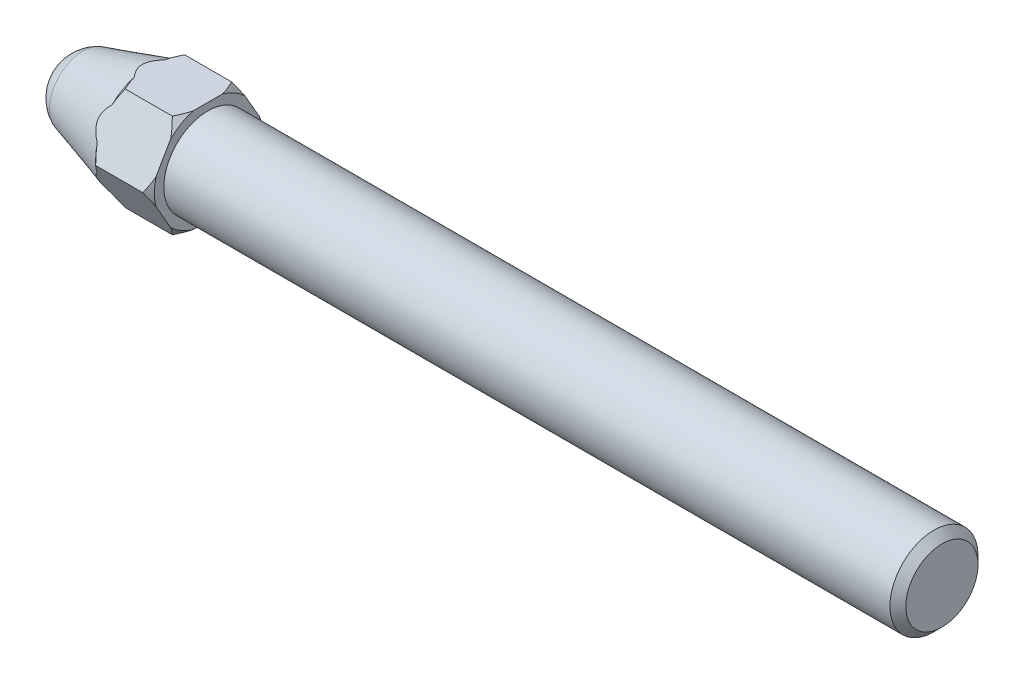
ISO-10303-21;
HEADER;
FILE_DESCRIPTION(('STEP AP214'),'2;1');
FILE_NAME('part.step','',(''),(''),'','','');
FILE_SCHEMA(('AUTOMOTIVE_DESIGN { 1 0 10303 214 1 1 1 1 }'));
ENDSEC;
DATA;
#1=APPLICATION_CONTEXT('core data for automotive mechanical design processes');
#2=APPLICATION_PROTOCOL_DEFINITION('international standard','automotive_design',2000,#1);
#3=PRODUCT_CONTEXT('',#1,'mechanical');
#4=PRODUCT('Part','Part','',(#3));
#5=PRODUCT_RELATED_PRODUCT_CATEGORY('part','',(#4));
#6=PRODUCT_DEFINITION_FORMATION('','',#4);
#7=PRODUCT_DEFINITION_CONTEXT('part definition',#1,'design');
#8=PRODUCT_DEFINITION('design','',#6,#7);
#9=PRODUCT_DEFINITION_SHAPE('','',#8);
#10=(LENGTH_UNIT() NAMED_UNIT(*) SI_UNIT(.MILLI.,.METRE.));
#11=(NAMED_UNIT(*) PLANE_ANGLE_UNIT() SI_UNIT($,.RADIAN.));
#12=(NAMED_UNIT(*) SI_UNIT($,.STERADIAN.) SOLID_ANGLE_UNIT());
#13=UNCERTAINTY_MEASURE_WITH_UNIT(LENGTH_MEASURE(1.E-05),#10,'distance_accuracy_value','');
#14=(GEOMETRIC_REPRESENTATION_CONTEXT(3) GLOBAL_UNCERTAINTY_ASSIGNED_CONTEXT((#13)) GLOBAL_UNIT_ASSIGNED_CONTEXT((#10,
#11,#12)) REPRESENTATION_CONTEXT('',''));
#15=CARTESIAN_POINT('',(0.,0.,0.));
#16=DIRECTION('',(0.,0.,1.));
#17=DIRECTION('',(1.,0.,0.));
#18=AXIS2_PLACEMENT_3D('',#15,#16,#17);
#19=CARTESIAN_POINT('',(-0.4,0.,0.));
#20=DIRECTION('',(-1.,0.,0.));
#21=DIRECTION('',(0.,0.,1.));
#22=AXIS2_PLACEMENT_3D('',#19,#20,#21);
#23=CONICAL_SURFACE('',#22,4.04145,0.785398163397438);
#24=CARTESIAN_POINT('',(1.99999999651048E-06,-0.879587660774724,-3.53361982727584));
#25=CARTESIAN_POINT('',(-0.024278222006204,-0.803403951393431,-3.57760451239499));
#26=CARTESIAN_POINT('',(-0.0512847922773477,-0.727906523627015,-3.62119297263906));
#27=CARTESIAN_POINT('',(-0.109995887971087,-0.578486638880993,-3.70746058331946));
#28=CARTESIAN_POINT('',(-0.141689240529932,-0.504560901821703,-3.75014162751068));
#29=CARTESIAN_POINT('',(-0.209125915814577,-0.358158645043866,-3.83466700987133));
#30=CARTESIAN_POINT('',(-0.244867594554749,-0.285681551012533,-3.87651167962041));
#31=CARTESIAN_POINT('',(-0.319916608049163,-0.141916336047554,-3.95951456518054));
#32=CARTESIAN_POINT('',(-0.359232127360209,-0.0706314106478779,-4.0006709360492));
#33=CARTESIAN_POINT('',(-0.400001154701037,2.00000000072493E-06,-4.04145115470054));
#34=B_SPLINE_CURVE_WITH_KNOTS('',3,(#24,#25,#26,#27,#28,#29,#30,#31,#32,#33),.UNSPECIFIED.,.F.,
.F.,(4,2,2,2,4),(0.,0.273676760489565,0.546711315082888,0.819635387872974,1.09320104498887),.UNSPECIFIED.);
#35=CARTESIAN_POINT('',(0.,-0.87958138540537,-3.53362345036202));
#36=VERTEX_POINT('',#35);
#37=CARTESIAN_POINT('',(-0.4,0.,-4.04145));
#38=VERTEX_POINT('',#37);
#39=EDGE_CURVE('E283',#36,#38,#34,.T.);
#40=ORIENTED_EDGE('',*,*,#39,.T.);
#41=CARTESIAN_POINT('',(-0.400001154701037,-2.E-06,-4.04145115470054));
#42=CARTESIAN_POINT('',(-0.359232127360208,0.070631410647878,-4.0006709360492));
#43=CARTESIAN_POINT('',(-0.319916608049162,0.141916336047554,-3.95951456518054));
#44=CARTESIAN_POINT('',(-0.244867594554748,0.285681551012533,-3.87651167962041));
#45=CARTESIAN_POINT('',(-0.209125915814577,0.358158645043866,-3.83466700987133));
#46=CARTESIAN_POINT('',(-0.141689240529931,0.504560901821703,-3.75014162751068));
#47=CARTESIAN_POINT('',(-0.109995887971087,0.578486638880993,-3.70746058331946));
#48=CARTESIAN_POINT('',(-0.0512847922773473,0.727906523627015,-3.62119297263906));
#49=CARTESIAN_POINT('',(-0.0242782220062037,0.803403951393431,-3.57760451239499));
#50=CARTESIAN_POINT('',(1.99999999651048E-06,0.879587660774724,-3.53361982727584));
#51=B_SPLINE_CURVE_WITH_KNOTS('',3,(#41,#42,#43,#44,#45,#46,#47,#48,#49,#50),.UNSPECIFIED.,.F.,
.F.,(4,2,2,2,4),(0.,0.273565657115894,0.54648972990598,0.819524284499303,1.09320104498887),.UNSPECIFIED.);
#52=CARTESIAN_POINT('',(0.,0.879581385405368,-3.53362345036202));
#53=VERTEX_POINT('',#52);
#54=EDGE_CURVE('E161',#38,#53,#51,.T.);
#55=ORIENTED_EDGE('',*,*,#54,.T.);
#56=CARTESIAN_POINT('',(0.,0.,0.));
#57=DIRECTION('',(1.,0.,0.));
#58=DIRECTION('',(0.,0.,-1.));
#59=AXIS2_PLACEMENT_3D('',#56,#57,#58);
#60=CIRCLE('',#59,3.64145);
#61=EDGE_CURVE('E454',#36,#53,#60,.T.);
#62=ORIENTED_EDGE('',*,*,#61,.F.);
#63=EDGE_LOOP('',(#40,#55,#62));
#64=FACE_BOUND('',#63,.T.);
#65=ADVANCED_FACE('F15',(#64),#23,.T.);
#66=CARTESIAN_POINT('',(-1.88309001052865,-3.49999836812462,4.27440683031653));
#67=CARTESIAN_POINT('',(-1.80337631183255,-3.49999836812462,4.17135627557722));
#68=CARTESIAN_POINT('',(-1.72436090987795,-3.49999836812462,4.06775702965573));
#69=CARTESIAN_POINT('',(-1.56804760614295,-3.49999836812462,3.85923457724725));
#70=CARTESIAN_POINT('',(-1.4907501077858,-3.49999836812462,3.75431106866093));
#71=CARTESIAN_POINT('',(-1.33764370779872,-3.49999836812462,3.54214755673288));
#72=CARTESIAN_POINT('',(-1.26185085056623,-3.49999836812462,3.43489593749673));
#73=CARTESIAN_POINT('',(-1.11284810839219,-3.49999836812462,3.21861917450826));
#74=CARTESIAN_POINT('',(-1.0396380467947,-3.49999836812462,3.10959415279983));
#75=CARTESIAN_POINT('',(-0.891712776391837,-3.49999836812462,2.88227487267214));
#76=CARTESIAN_POINT('',(-0.817211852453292,-3.49999836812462,2.76384047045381));
#77=CARTESIAN_POINT('',(-0.672754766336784,-3.49999836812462,2.52418698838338));
#78=CARTESIAN_POINT('',(-0.602799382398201,-3.49999836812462,2.40296743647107));
#79=CARTESIAN_POINT('',(-0.468917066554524,-3.49999836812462,2.15769718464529));
#80=CARTESIAN_POINT('',(-0.404972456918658,-3.49999836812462,2.03365621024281));
#81=CARTESIAN_POINT('',(-0.284544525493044,-3.49999836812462,1.78203222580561));
#82=CARTESIAN_POINT('',(-0.228057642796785,-3.49999836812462,1.65445094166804));
#83=CARTESIAN_POINT('',(-0.129974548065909,-3.49999836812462,1.40888788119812));
#84=CARTESIAN_POINT('',(-0.0874413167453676,-3.49999836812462,1.29128419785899));
#85=CARTESIAN_POINT('',(-0.0117837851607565,-3.49999836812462,1.05303163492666));
#86=CARTESIAN_POINT('',(0.0213399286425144,-3.49999836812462,0.932382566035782));
#87=CARTESIAN_POINT('',(0.075812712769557,-3.49999836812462,0.690890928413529));
#88=CARTESIAN_POINT('',(0.0973794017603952,-3.49999836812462,0.570098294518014));
#89=CARTESIAN_POINT('',(0.128279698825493,-3.49999836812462,0.326949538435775));
#90=CARTESIAN_POINT('',(0.137615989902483,-3.49999836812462,0.204593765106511));
#91=CARTESIAN_POINT('',(0.143229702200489,-3.49999836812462,-0.03476533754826));
#92=CARTESIAN_POINT('',(0.140089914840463,-3.49999836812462,-0.151755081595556));
#93=CARTESIAN_POINT('',(0.122276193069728,-3.49999836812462,-0.384847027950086));
#94=CARTESIAN_POINT('',(0.10760123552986,-3.49999836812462,-0.500949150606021));
#95=CARTESIAN_POINT('',(0.0673063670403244,-3.49999836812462,-0.733395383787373));
#96=CARTESIAN_POINT('',(0.0414910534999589,-3.49999836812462,-0.849705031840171));
#97=CARTESIAN_POINT('',(-0.0196353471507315,-3.49999836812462,-1.07975342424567));
#98=CARTESIAN_POINT('',(-0.0549459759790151,-3.49999836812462,-1.1934922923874));
#99=CARTESIAN_POINT('',(-0.135370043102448,-3.49999836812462,-1.42357282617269));
#100=CARTESIAN_POINT('',(-0.180873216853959,-3.49999836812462,-1.53977664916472));
#101=CARTESIAN_POINT('',(-0.278913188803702,-3.49999836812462,-1.76918670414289));
#102=CARTESIAN_POINT('',(-0.331452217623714,-3.49999836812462,-1.88239197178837));
#103=CARTESIAN_POINT('',(-0.442327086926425,-3.49999836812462,-2.10635810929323));
#104=CARTESIAN_POINT('',(-0.500681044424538,-3.49999836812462,-2.21710993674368));
#105=CARTESIAN_POINT('',(-0.621900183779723,-3.49999836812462,-2.4360782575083));
#106=CARTESIAN_POINT('',(-0.684764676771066,-3.49999836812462,-2.544295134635));
#107=CARTESIAN_POINT('',(-0.810936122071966,-3.49999836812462,-2.75324162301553));
#108=CARTESIAN_POINT('',(-0.874068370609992,-3.49999836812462,-2.85407728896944));
#109=CARTESIAN_POINT('',(-1.00302727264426,-3.49999836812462,-3.05401596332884));
#110=CARTESIAN_POINT('',(-1.06885412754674,-3.49999836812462,-3.15311884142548));
#111=CARTESIAN_POINT('',(-1.20218806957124,-3.49999836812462,-3.3490236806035));
#112=CARTESIAN_POINT('',(-1.26967748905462,-3.49999836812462,-3.44583770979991));
#113=CARTESIAN_POINT('',(-1.4064709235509,-3.49999836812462,-3.6381365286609));
#114=CARTESIAN_POINT('',(-1.47577443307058,-3.49999836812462,-3.73362167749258));
#115=CARTESIAN_POINT('',(-1.54582069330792,-3.49999836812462,-3.82854915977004));
#116=B_SPLINE_CURVE_WITH_KNOTS('',3,(#66,#67,#68,#69,#70,#71,#72,#73,#74,#75,#76,#77,#78,#79,
#80,#81,#82,#83,#84,#85,#86,#87,#88,#89,#90,#91,#92,#93,#94,#95,#96,#97,#98,#99,#100,#101,#102,
#103,#104,#105,#106,#107,#108,#109,#110,#111,#112,#113,#114,#115),.UNSPECIFIED.,.F.,.F.,(4,2,2,
2,2,2,2,2,2,2,2,2,2,2,2,2,2,2,2,2,2,2,2,2,4),(0.,0.390856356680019,0.781803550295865,
1.17576092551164,1.56969130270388,1.98936472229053,2.40910980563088,2.82757903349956,
3.24584772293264,3.62070247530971,3.99558058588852,4.36312681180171,4.73059239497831,
5.08109916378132,5.43163702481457,5.78859055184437,6.14552685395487,6.51962707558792,
6.89384618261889,7.26927000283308,7.64463660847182,8.00149204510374,8.35837420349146,
8.71239962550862,9.0663274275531),.UNSPECIFIED.);
#117=CARTESIAN_POINT('',(0.,-3.49999836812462,-1.00507190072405));
#118=VERTEX_POINT('',#117);
#119=CARTESIAN_POINT('',(-0.4,-3.49999836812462,-2.020725));
#120=VERTEX_POINT('',#119);
#121=EDGE_CURVE('E318',#118,#120,#116,.T.);
#122=ORIENTED_EDGE('',*,*,#121,.T.);
#123=CARTESIAN_POINT('',(-0.400001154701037,-3.50000036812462,-2.02072384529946));
#124=CARTESIAN_POINT('',(-0.359232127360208,-3.42936695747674,-2.06150406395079));
#125=CARTESIAN_POINT('',(-0.319916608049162,-3.35808203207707,-2.10266043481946));
#126=CARTESIAN_POINT('',(-0.244867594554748,-3.21431681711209,-2.1856633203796));
#127=CARTESIAN_POINT('',(-0.209125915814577,-3.14183972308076,-2.22750799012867));
#128=CARTESIAN_POINT('',(-0.141689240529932,-2.99543746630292,-2.31203337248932));
#129=CARTESIAN_POINT('',(-0.109995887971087,-2.92151172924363,-2.35471441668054));
#130=CARTESIAN_POINT('',(-0.0512847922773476,-2.77209184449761,-2.44098202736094));
#131=CARTESIAN_POINT('',(-0.0242782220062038,-2.69659441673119,-2.48457048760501));
#132=CARTESIAN_POINT('',(1.99999999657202E-06,-2.62041070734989,-2.52855517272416));
#133=B_SPLINE_CURVE_WITH_KNOTS('',3,(#123,#124,#125,#126,#127,#128,#129,#130,#131,#132),
.UNSPECIFIED.,.F.,.F.,(4,2,2,2,4),(0.,0.273565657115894,0.54648972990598,0.819524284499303,
1.09320104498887),.UNSPECIFIED.);
#134=CARTESIAN_POINT('',(0.,-2.62041698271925,-2.52855154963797));
#135=VERTEX_POINT('',#134);
#136=EDGE_CURVE('E277',#120,#135,#133,.T.);
#137=ORIENTED_EDGE('',*,*,#136,.T.);
#138=EDGE_CURVE('E481',#118,#135,#60,.T.);
#139=ORIENTED_EDGE('',*,*,#138,.F.);
#140=EDGE_LOOP('',(#122,#137,#139));
#141=FACE_BOUND('',#140,.T.);
#142=ADVANCED_FACE('F506',(#141),#23,.T.);
#143=CARTESIAN_POINT('',(1.99999999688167E-06,-2.6204107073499,2.52855517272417));
#144=CARTESIAN_POINT('',(-0.0242782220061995,-2.69659441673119,2.48457048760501));
#145=CARTESIAN_POINT('',(-0.0512847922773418,-2.77209184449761,2.44098202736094));
#146=CARTESIAN_POINT('',(-0.109995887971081,-2.92151172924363,2.35471441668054));
#147=CARTESIAN_POINT('',(-0.141689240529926,-2.99543746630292,2.31203337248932));
#148=CARTESIAN_POINT('',(-0.209125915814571,-3.14183972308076,2.22750799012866));
#149=CARTESIAN_POINT('',(-0.244867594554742,-3.21431681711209,2.18566332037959));
#150=CARTESIAN_POINT('',(-0.319916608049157,-3.35808203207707,2.10266043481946));
#151=CARTESIAN_POINT('',(-0.359232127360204,-3.42936695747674,2.06150406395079));
#152=CARTESIAN_POINT('',(-0.400001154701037,-3.50000036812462,2.02072384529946));
#153=B_SPLINE_CURVE_WITH_KNOTS('',3,(#143,#144,#145,#146,#147,#148,#149,#150,#151,#152),
.UNSPECIFIED.,.F.,.F.,(4,2,2,2,4),(0.,0.273676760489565,0.546711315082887,0.819635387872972,
1.09320104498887),.UNSPECIFIED.);
#154=CARTESIAN_POINT('',(0.,-2.62041698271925,2.52855154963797));
#155=VERTEX_POINT('',#154);
#156=CARTESIAN_POINT('',(-0.4,-3.49999836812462,2.020725));
#157=VERTEX_POINT('',#156);
#158=EDGE_CURVE('E350',#155,#157,#153,.T.);
#159=ORIENTED_EDGE('',*,*,#158,.T.);
#160=CARTESIAN_POINT('',(0.,-3.49999836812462,1.00507190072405));
#161=VERTEX_POINT('',#160);
#162=EDGE_CURVE('E311',#157,#161,#116,.T.);
#163=ORIENTED_EDGE('',*,*,#162,.T.);
#164=EDGE_CURVE('E488',#155,#161,#60,.T.);
#165=ORIENTED_EDGE('',*,*,#164,.F.);
#166=EDGE_LOOP('',(#159,#163,#165));
#167=FACE_BOUND('',#166,.T.);
#168=ADVANCED_FACE('F503',(#167),#23,.T.);
#169=CARTESIAN_POINT('',(1.9999999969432E-06,0.879587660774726,3.53361982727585));
#170=CARTESIAN_POINT('',(-0.0242782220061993,0.803403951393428,3.577604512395));
#171=CARTESIAN_POINT('',(-0.0512847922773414,0.72790652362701,3.62119297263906));
#172=CARTESIAN_POINT('',(-0.10999588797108,0.578486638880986,3.70746058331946));
#173=CARTESIAN_POINT('',(-0.141689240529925,0.504560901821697,3.75014162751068));
#174=CARTESIAN_POINT('',(-0.20912591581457,0.35815864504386,3.83466700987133));
#175=CARTESIAN_POINT('',(-0.244867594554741,0.285681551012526,3.87651167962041));
#176=CARTESIAN_POINT('',(-0.319916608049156,0.141916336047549,3.95951456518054));
#177=CARTESIAN_POINT('',(-0.359232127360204,0.0706314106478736,4.00067093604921));
#178=CARTESIAN_POINT('',(-0.400001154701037,-2.00000000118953E-06,4.04145115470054));
#179=B_SPLINE_CURVE_WITH_KNOTS('',3,(#169,#170,#171,#172,#173,#174,#175,#176,#177,#178),
.UNSPECIFIED.,.F.,.F.,(4,2,2,2,4),(0.,0.273676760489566,0.546711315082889,0.819635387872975,
1.09320104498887),.UNSPECIFIED.);
#180=CARTESIAN_POINT('',(0.,0.879581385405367,3.53362345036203));
#181=VERTEX_POINT('',#180);
#182=CARTESIAN_POINT('',(-0.4,0.,4.04145));
#183=VERTEX_POINT('',#182);
#184=EDGE_CURVE('E410',#181,#183,#179,.T.);
#185=ORIENTED_EDGE('',*,*,#184,.T.);
#186=CARTESIAN_POINT('',(-0.400001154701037,2.00000000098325E-06,4.04145115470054));
#187=CARTESIAN_POINT('',(-0.359232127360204,-0.0706314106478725,4.00067093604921));
#188=CARTESIAN_POINT('',(-0.319916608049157,-0.141916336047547,3.95951456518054));
#189=CARTESIAN_POINT('',(-0.244867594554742,-0.285681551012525,3.87651167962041));
#190=CARTESIAN_POINT('',(-0.20912591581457,-0.358158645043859,3.83466700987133));
#191=CARTESIAN_POINT('',(-0.141689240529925,-0.504560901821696,3.75014162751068));
#192=CARTESIAN_POINT('',(-0.10999588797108,-0.578486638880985,3.70746058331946));
#193=CARTESIAN_POINT('',(-0.0512847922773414,-0.727906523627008,3.62119297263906));
#194=CARTESIAN_POINT('',(-0.0242782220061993,-0.803403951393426,3.577604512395));
#195=CARTESIAN_POINT('',(1.9999999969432E-06,-0.879587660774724,3.53361982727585));
#196=B_SPLINE_CURVE_WITH_KNOTS('',3,(#186,#187,#188,#189,#190,#191,#192,#193,#194,#195),
.UNSPECIFIED.,.F.,.F.,(4,2,2,2,4),(0.,0.273565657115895,0.546489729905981,0.819524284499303,
1.09320104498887),.UNSPECIFIED.);
#197=CARTESIAN_POINT('',(0.,-0.879581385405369,3.53362345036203));
#198=VERTEX_POINT('',#197);
#199=EDGE_CURVE('E357',#183,#198,#196,.T.);
#200=ORIENTED_EDGE('',*,*,#199,.T.);
#201=EDGE_CURVE('E497',#181,#198,#60,.T.);
#202=ORIENTED_EDGE('',*,*,#201,.F.);
#203=EDGE_LOOP('',(#185,#200,#202));
#204=FACE_BOUND('',#203,.T.);
#205=ADVANCED_FACE('F505',(#204),#23,.T.);
#206=CARTESIAN_POINT('',(0.,2.62041698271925,-2.52855154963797));
#207=VERTEX_POINT('',#206);
#208=CARTESIAN_POINT('',(0.,3.49999836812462,-1.00507190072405));
#209=VERTEX_POINT('',#208);
#210=EDGE_CURVE('E159',#207,#209,#60,.T.);
#211=ORIENTED_EDGE('',*,*,#210,.F.);
#212=CARTESIAN_POINT('',(1.99999999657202E-06,2.62041070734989,-2.52855517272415));
#213=CARTESIAN_POINT('',(-0.0242782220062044,2.69659441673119,-2.484570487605));
#214=CARTESIAN_POINT('',(-0.0512847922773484,2.77209184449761,-2.44098202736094));
#215=CARTESIAN_POINT('',(-0.109995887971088,2.92151172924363,-2.35471441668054));
#216=CARTESIAN_POINT('',(-0.141689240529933,2.99543746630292,-2.31203337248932));
#217=CARTESIAN_POINT('',(-0.209125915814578,3.14183972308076,-2.22750799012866));
#218=CARTESIAN_POINT('',(-0.24486759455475,3.21431681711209,-2.18566332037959));
#219=CARTESIAN_POINT('',(-0.319916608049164,3.35808203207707,-2.10266043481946));
#220=CARTESIAN_POINT('',(-0.35923212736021,3.42936695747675,-2.06150406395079));
#221=CARTESIAN_POINT('',(-0.400001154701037,3.50000036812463,-2.02072384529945));
#222=B_SPLINE_CURVE_WITH_KNOTS('',3,(#212,#213,#214,#215,#216,#217,#218,#219,#220,#221),
.UNSPECIFIED.,.F.,.F.,(4,2,2,2,4),(0.,0.273676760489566,0.546711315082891,0.819635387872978,
1.09320104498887),.UNSPECIFIED.);
#223=CARTESIAN_POINT('',(-0.4,3.49999836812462,-2.020725));
#224=VERTEX_POINT('',#223);
#225=EDGE_CURVE('E151',#207,#224,#222,.T.);
#226=ORIENTED_EDGE('',*,*,#225,.T.);
#227=CARTESIAN_POINT('',(-1.88309001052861,3.49999836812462,4.27440683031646));
#228=CARTESIAN_POINT('',(-1.8033763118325,3.49999836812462,4.17135627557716));
#229=CARTESIAN_POINT('',(-1.7243609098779,3.49999836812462,4.06775702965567));
#230=CARTESIAN_POINT('',(-1.5680476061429,3.49999836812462,3.85923457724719));
#231=CARTESIAN_POINT('',(-1.49075010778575,3.49999836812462,3.75431106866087));
#232=CARTESIAN_POINT('',(-1.33764370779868,3.49999836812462,3.54214755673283));
#233=CARTESIAN_POINT('',(-1.26185085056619,3.49999836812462,3.43489593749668));
#234=CARTESIAN_POINT('',(-1.11284810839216,3.49999836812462,3.21861917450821));
#235=CARTESIAN_POINT('',(-1.03963804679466,3.49999836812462,3.10959415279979));
#236=CARTESIAN_POINT('',(-0.891712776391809,3.49999836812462,2.8822748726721));
#237=CARTESIAN_POINT('',(-0.817211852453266,3.49999836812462,2.76384047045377));
#238=CARTESIAN_POINT('',(-0.672754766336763,3.49999836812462,2.52418698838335));
#239=CARTESIAN_POINT('',(-0.602799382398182,3.49999836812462,2.40296743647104));
#240=CARTESIAN_POINT('',(-0.468917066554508,3.49999836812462,2.15769718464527));
#241=CARTESIAN_POINT('',(-0.404972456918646,3.49999836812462,2.03365621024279));
#242=CARTESIAN_POINT('',(-0.284544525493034,3.49999836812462,1.78203222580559));
#243=CARTESIAN_POINT('',(-0.228057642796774,3.49999836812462,1.65445094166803));
#244=CARTESIAN_POINT('',(-0.1299745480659,3.49999836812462,1.40888788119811));
#245=CARTESIAN_POINT('',(-0.0874413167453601,3.49999836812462,1.29128419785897));
#246=CARTESIAN_POINT('',(-0.0117837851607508,3.49999836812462,1.05303163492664));
#247=CARTESIAN_POINT('',(0.0213399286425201,3.49999836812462,0.93238256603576));
#248=CARTESIAN_POINT('',(0.0758127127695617,3.49999836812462,0.690890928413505));
#249=CARTESIAN_POINT('',(0.097379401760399,3.49999836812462,0.570098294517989));
#250=CARTESIAN_POINT('',(0.128279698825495,3.49999836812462,0.326949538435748));
#251=CARTESIAN_POINT('',(0.137615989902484,3.49999836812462,0.204593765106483));
#252=CARTESIAN_POINT('',(0.143229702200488,3.49999836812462,-0.0347653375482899));
#253=CARTESIAN_POINT('',(0.14008991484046,3.49999836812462,-0.151755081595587));
#254=CARTESIAN_POINT('',(0.122276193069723,3.49999836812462,-0.384847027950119));
#255=CARTESIAN_POINT('',(0.107601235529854,3.49999836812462,-0.500949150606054));
#256=CARTESIAN_POINT('',(0.067306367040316,3.49999836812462,-0.733395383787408));
#257=CARTESIAN_POINT('',(0.0414910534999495,3.49999836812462,-0.849705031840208));
#258=CARTESIAN_POINT('',(-0.0196353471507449,3.49999836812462,-1.07975342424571));
#259=CARTESIAN_POINT('',(-0.0549459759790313,3.49999836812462,-1.19349229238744));
#260=CARTESIAN_POINT('',(-0.135370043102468,3.49999836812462,-1.42357282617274));
#261=CARTESIAN_POINT('',(-0.180873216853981,3.49999836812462,-1.53977664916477));
#262=CARTESIAN_POINT('',(-0.278913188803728,3.49999836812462,-1.76918670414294));
#263=CARTESIAN_POINT('',(-0.331452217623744,3.49999836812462,-1.88239197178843));
#264=CARTESIAN_POINT('',(-0.442327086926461,3.49999836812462,-2.1063581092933));
#265=CARTESIAN_POINT('',(-0.500681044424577,3.49999836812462,-2.21710993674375));
#266=CARTESIAN_POINT('',(-0.621900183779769,3.49999836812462,-2.43607825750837));
#267=CARTESIAN_POINT('',(-0.684764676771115,3.49999836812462,-2.54429513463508));
#268=CARTESIAN_POINT('',(-0.810936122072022,3.49999836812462,-2.75324162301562));
#269=CARTESIAN_POINT('',(-0.87406837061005,3.49999836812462,-2.85407728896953));
#270=CARTESIAN_POINT('',(-1.00302727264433,3.49999836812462,-3.05401596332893));
#271=CARTESIAN_POINT('',(-1.0688541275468,3.49999836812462,-3.15311884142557));
#272=CARTESIAN_POINT('',(-1.20218806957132,3.49999836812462,-3.3490236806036));
#273=CARTESIAN_POINT('',(-1.2696774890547,3.49999836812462,-3.44583770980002));
#274=CARTESIAN_POINT('',(-1.40647092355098,3.49999836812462,-3.63813652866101));
#275=CARTESIAN_POINT('',(-1.47577443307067,3.49999836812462,-3.7336216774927));
#276=CARTESIAN_POINT('',(-1.545820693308,3.49999836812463,-3.82854915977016));
#277=B_SPLINE_CURVE_WITH_KNOTS('',3,(#227,#228,#229,#230,#231,#232,#233,#234,#235,#236,#237,
#238,#239,#240,#241,#242,#243,#244,#245,#246,#247,#248,#249,#250,#251,#252,#253,#254,#255,#256,
#257,#258,#259,#260,#261,#262,#263,#264,#265,#266,#267,#268,#269,#270,#271,#272,#273,#274,#275,
#276),.UNSPECIFIED.,.F.,.F.,(4,2,2,2,2,2,2,2,2,2,2,2,2,2,2,2,2,2,2,2,2,2,2,2,4),(0.,
0.390856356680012,0.78180355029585,1.17576092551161,1.56969130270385,1.98936472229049,
2.40910980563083,2.82757903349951,3.24584772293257,3.62070247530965,3.99558058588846,
4.36312681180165,4.73059239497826,5.08109916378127,5.43163702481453,5.78859055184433,
6.14552685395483,6.51962707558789,6.89384618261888,7.26927000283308,7.64463660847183,
8.00149204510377,8.3583742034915,8.71239962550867,9.06632742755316),.UNSPECIFIED.);
#278=EDGE_CURVE('E139',#224,#209,#277,.F.);
#279=ORIENTED_EDGE('',*,*,#278,.T.);
#280=EDGE_LOOP('',(#211,#226,#279));
#281=FACE_BOUND('',#280,.T.);
#282=ADVANCED_FACE('F158',(#281),#23,.T.);
#283=CARTESIAN_POINT('',(0.,3.49999836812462,1.00507190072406));
#284=VERTEX_POINT('',#283);
#285=CARTESIAN_POINT('',(-0.4,3.49999836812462,2.020725));
#286=VERTEX_POINT('',#285);
#287=EDGE_CURVE('E38',#284,#286,#277,.F.);
#288=ORIENTED_EDGE('',*,*,#287,.T.);
#289=CARTESIAN_POINT('',(-0.400001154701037,3.50000036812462,2.02072384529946));
#290=CARTESIAN_POINT('',(-0.359232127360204,3.42936695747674,2.0615040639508));
#291=CARTESIAN_POINT('',(-0.319916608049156,3.35808203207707,2.10266043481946));
#292=CARTESIAN_POINT('',(-0.244867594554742,3.21431681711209,2.18566332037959));
#293=CARTESIAN_POINT('',(-0.20912591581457,3.14183972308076,2.22750799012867));
#294=CARTESIAN_POINT('',(-0.141689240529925,2.99543746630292,2.31203337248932));
#295=CARTESIAN_POINT('',(-0.10999588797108,2.92151172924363,2.35471441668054));
#296=CARTESIAN_POINT('',(-0.0512847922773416,2.77209184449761,2.44098202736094));
#297=CARTESIAN_POINT('',(-0.0242782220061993,2.69659441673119,2.48457048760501));
#298=CARTESIAN_POINT('',(1.99999999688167E-06,2.62041070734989,2.52855517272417));
#299=B_SPLINE_CURVE_WITH_KNOTS('',3,(#289,#290,#291,#292,#293,#294,#295,#296,#297,#298),
.UNSPECIFIED.,.F.,.F.,(4,2,2,2,4),(0.,0.273565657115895,0.546489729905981,0.819524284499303,
1.09320104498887),.UNSPECIFIED.);
#300=CARTESIAN_POINT('',(0.,2.62041698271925,2.52855154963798));
#301=VERTEX_POINT('',#300);
#302=EDGE_CURVE('E404',#286,#301,#299,.T.);
#303=ORIENTED_EDGE('',*,*,#302,.T.);
#304=EDGE_CURVE('E492',#284,#301,#60,.T.);
#305=ORIENTED_EDGE('',*,*,#304,.F.);
#306=EDGE_LOOP('',(#288,#303,#305));
#307=FACE_BOUND('',#306,.T.);
#308=ADVANCED_FACE('F514',(#307),#23,.T.);
#309=CARTESIAN_POINT('',(0.,3.64145,0.));
#310=DIRECTION('',(-1.,0.,0.));
#311=DIRECTION('',(0.,0.,1.));
#312=AXIS2_PLACEMENT_3D('',#309,#310,#311);
#313=PLANE('',#312);
#314=CARTESIAN_POINT('',(0.,0.,0.));
#315=DIRECTION('',(1.,0.,0.));
#316=DIRECTION('',(0.,0.,-1.));
#317=AXIS2_PLACEMENT_3D('',#314,#315,#316);
#318=CIRCLE('',#317,3.);
#319=CARTESIAN_POINT('',(0.,0.,-3.));
#320=VERTEX_POINT('',#319);
#321=EDGE_CURVE('E484',#320,#320,#318,.T.);
#322=ORIENTED_EDGE('',*,*,#321,.F.);
#323=EDGE_LOOP('',(#322));
#324=FACE_BOUND('',#323,.T.);
#325=ORIENTED_EDGE('',*,*,#61,.T.);
#326=DIRECTION('',(0.,0.866025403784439,0.5));
#327=VECTOR('',#326,1.);
#328=CARTESIAN_POINT('',(0.,4.48108668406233,-1.45429339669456));
#329=LINE('',#328,#327);
#330=EDGE_CURVE('E10',#53,#207,#329,.T.);
#331=ORIENTED_EDGE('',*,*,#330,.T.);
#332=ORIENTED_EDGE('',*,*,#210,.T.);
#333=DIRECTION('',(0.,0.,1.));
#334=VECTOR('',#333,1.);
#335=CARTESIAN_POINT('',(0.,3.49999836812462,0.));
#336=LINE('',#335,#334);
#337=EDGE_CURVE('E141',#209,#284,#336,.T.);
#338=ORIENTED_EDGE('',*,*,#337,.T.);
#339=ORIENTED_EDGE('',*,*,#304,.T.);
#340=DIRECTION('',(0.,-0.866025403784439,0.5));
#341=VECTOR('',#340,1.);
#342=CARTESIAN_POINT('',(0.,4.48108668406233,1.45429339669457));
#343=LINE('',#342,#341);
#344=EDGE_CURVE('E461',#301,#181,#343,.T.);
#345=ORIENTED_EDGE('',*,*,#344,.T.);
#346=ORIENTED_EDGE('',*,*,#201,.T.);
#347=DIRECTION('',(0.,-0.866025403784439,-0.5));
#348=VECTOR('',#347,1.);
#349=CARTESIAN_POINT('',(0.,0.981088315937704,4.60788160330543));
#350=LINE('',#349,#348);
#351=EDGE_CURVE('E465',#198,#155,#350,.T.);
#352=ORIENTED_EDGE('',*,*,#351,.T.);
#353=ORIENTED_EDGE('',*,*,#164,.T.);
#354=DIRECTION('',(0.,0.,-1.));
#355=VECTOR('',#354,1.);
#356=CARTESIAN_POINT('',(0.,-3.49999836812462,0.));
#357=LINE('',#356,#355);
#358=EDGE_CURVE('E469',#161,#118,#357,.T.);
#359=ORIENTED_EDGE('',*,*,#358,.T.);
#360=ORIENTED_EDGE('',*,*,#138,.T.);
#361=DIRECTION('',(0.,0.866025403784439,-0.5));
#362=VECTOR('',#361,1.);
#363=CARTESIAN_POINT('',(0.,0.981088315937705,-4.60788160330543));
#364=LINE('',#363,#362);
#365=EDGE_CURVE('E24',#135,#36,#364,.T.);
#366=ORIENTED_EDGE('',*,*,#365,.T.);
#367=EDGE_LOOP('',(#325,#331,#332,#338,#339,#345,#346,#352,#353,#359,#360,#366));
#368=FACE_BOUND('',#367,.T.);
#369=ADVANCED_FACE('F479',(#324,#368),#313,.F.);
#370=CARTESIAN_POINT('',(50.,2.45866165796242,0.));
#371=DIRECTION('',(-1.,0.,0.));
#372=DIRECTION('',(0.,0.,1.));
#373=AXIS2_PLACEMENT_3D('',#370,#371,#372);
#374=PLANE('',#373);
#375=CARTESIAN_POINT('',(50.,0.,0.));
#376=DIRECTION('',(1.,0.,0.));
#377=DIRECTION('',(0.,0.,-1.));
#378=AXIS2_PLACEMENT_3D('',#375,#376,#377);
#379=CIRCLE('',#378,2.45866165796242);
#380=CARTESIAN_POINT('',(50.,0.,-2.45866165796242));
#381=VERTEX_POINT('',#380);
#382=EDGE_CURVE('E673',#381,#381,#379,.T.);
#383=ORIENTED_EDGE('',*,*,#382,.T.);
#384=EDGE_LOOP('',(#383));
#385=FACE_BOUND('',#384,.T.);
#386=ADVANCED_FACE('F17',(#385),#374,.F.);
#387=CARTESIAN_POINT('',(50.,0.,0.));
#388=DIRECTION('',(1.,0.,0.));
#389=DIRECTION('',(0.,0.,-1.));
#390=AXIS2_PLACEMENT_3D('',#387,#388,#389);
#391=CYLINDRICAL_SURFACE('',#390,3.);
#392=CARTESIAN_POINT('',(49.4586616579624,0.,0.));
#393=DIRECTION('',(1.,0.,0.));
#394=DIRECTION('',(0.,0.,-1.));
#395=AXIS2_PLACEMENT_3D('',#392,#393,#394);
#396=CIRCLE('',#395,3.);
#397=CARTESIAN_POINT('',(49.4586616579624,0.,-3.));
#398=VERTEX_POINT('',#397);
#399=EDGE_CURVE('E491',#398,#398,#396,.T.);
#400=ORIENTED_EDGE('',*,*,#399,.F.);
#401=EDGE_LOOP('',(#400));
#402=FACE_BOUND('',#401,.T.);
#403=ORIENTED_EDGE('',*,*,#321,.T.);
#404=EDGE_LOOP('',(#403));
#405=FACE_BOUND('',#404,.T.);
#406=ADVANCED_FACE('F681',(#402,#405),#391,.T.);
#407=CARTESIAN_POINT('',(49.4586616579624,0.,0.));
#408=DIRECTION('',(-1.,0.,0.));
#409=DIRECTION('',(0.,0.,1.));
#410=AXIS2_PLACEMENT_3D('',#407,#408,#409);
#411=CONICAL_SURFACE('',#410,3.,0.78539816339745);
#412=ORIENTED_EDGE('',*,*,#382,.F.);
#413=EDGE_LOOP('',(#412));
#414=FACE_BOUND('',#413,.T.);
#415=ORIENTED_EDGE('',*,*,#399,.T.);
#416=EDGE_LOOP('',(#415));
#417=FACE_BOUND('',#416,.T.);
#418=ADVANCED_FACE('F196',(#414,#417),#411,.T.);
#419=CARTESIAN_POINT('',(-10.,3.49999836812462,-2.020725));
#420=DIRECTION('',(0.,-0.5,0.866025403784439));
#421=DIRECTION('',(0.,0.866025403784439,0.5));
#422=AXIS2_PLACEMENT_3D('',#419,#420,#421);
#423=PLANE('',#422);
#424=CARTESIAN_POINT('',(-3.59999884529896,3.50000036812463,-2.02072384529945));
#425=CARTESIAN_POINT('',(-3.64076787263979,3.42936695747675,-2.06150406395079));
#426=CARTESIAN_POINT('',(-3.68008339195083,3.35808203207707,-2.10266043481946));
#427=CARTESIAN_POINT('',(-3.75513240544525,3.21431681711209,-2.1856633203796));
#428=CARTESIAN_POINT('',(-3.79087408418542,3.14183972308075,-2.22750799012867));
#429=CARTESIAN_POINT('',(-3.85831075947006,2.99543746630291,-2.31203337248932));
#430=CARTESIAN_POINT('',(-3.89000411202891,2.92151172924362,-2.35471441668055));
#431=CARTESIAN_POINT('',(-3.94871520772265,2.7720918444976,-2.44098202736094));
#432=CARTESIAN_POINT('',(-3.9757217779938,2.69659441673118,-2.48457048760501));
#433=CARTESIAN_POINT('',(-4.000002,2.62041070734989,-2.52855517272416));
#434=B_SPLINE_CURVE_WITH_KNOTS('',3,(#424,#425,#426,#427,#428,#429,#430,#431,#432,#433),
.UNSPECIFIED.,.F.,.F.,(4,2,2,2,4),(0.,0.273565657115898,0.546489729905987,0.819524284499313,
1.09320104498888),.UNSPECIFIED.);
#435=CARTESIAN_POINT('',(-3.6,3.49999836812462,-2.020725));
#436=VERTEX_POINT('',#435);
#437=CARTESIAN_POINT('',(-4.,2.62041698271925,-2.52855154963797));
#438=VERTEX_POINT('',#437);
#439=EDGE_CURVE('E153',#436,#438,#434,.T.);
#440=ORIENTED_EDGE('',*,*,#439,.F.);
#441=DIRECTION('',(1.,0.,0.));
#442=VECTOR('',#441,1.);
#443=CARTESIAN_POINT('',(-10.,3.49999836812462,-2.020725));
#444=LINE('',#443,#442);
#445=EDGE_CURVE('E31',#436,#224,#444,.T.);
#446=ORIENTED_EDGE('',*,*,#445,.T.);
#447=ORIENTED_EDGE('',*,*,#225,.F.);
#448=ORIENTED_EDGE('',*,*,#330,.F.);
#449=ORIENTED_EDGE('',*,*,#54,.F.);
#450=DIRECTION('',(1.,0.,0.));
#451=VECTOR('',#450,1.);
#452=CARTESIAN_POINT('',(-10.,0.,-4.04145));
#453=LINE('',#452,#451);
#454=CARTESIAN_POINT('',(-3.6,0.,-4.04145));
#455=VERTEX_POINT('',#454);
#456=EDGE_CURVE('E525',#455,#38,#453,.T.);
#457=ORIENTED_EDGE('',*,*,#456,.F.);
#458=CARTESIAN_POINT('',(-4.000002,0.879587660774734,-3.53361982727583));
#459=CARTESIAN_POINT('',(-3.9757217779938,0.803403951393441,-3.57760451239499));
#460=CARTESIAN_POINT('',(-3.94871520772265,0.727906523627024,-3.62119297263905));
#461=CARTESIAN_POINT('',(-3.89000411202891,0.578486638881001,-3.70746058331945));
#462=CARTESIAN_POINT('',(-3.85831075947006,0.50456090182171,-3.75014162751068));
#463=CARTESIAN_POINT('',(-3.79087408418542,0.358158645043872,-3.83466700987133));
#464=CARTESIAN_POINT('',(-3.75513240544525,0.285681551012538,-3.8765116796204));
#465=CARTESIAN_POINT('',(-3.68008339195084,0.141916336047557,-3.95951456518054));
#466=CARTESIAN_POINT('',(-3.64076787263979,0.070631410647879,-4.0006709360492));
#467=CARTESIAN_POINT('',(-3.59999884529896,-2.00000000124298E-06,-4.04145115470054));
#468=B_SPLINE_CURVE_WITH_KNOTS('',3,(#458,#459,#460,#461,#462,#463,#464,#465,#466,#467),
.UNSPECIFIED.,.F.,.F.,(4,2,2,2,4),(0.,0.273676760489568,0.546711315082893,0.819635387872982,
1.09320104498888),.UNSPECIFIED.);
#469=CARTESIAN_POINT('',(-4.,0.879581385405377,-3.53362345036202));
#470=VERTEX_POINT('',#469);
#471=EDGE_CURVE('E169',#470,#455,#468,.T.);
#472=ORIENTED_EDGE('',*,*,#471,.F.);
#473=CARTESIAN_POINT('',(-3.999998,2.62041886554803,-2.52855046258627));
#474=CARTESIAN_POINT('',(-4.05423261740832,2.56922767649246,-2.55810570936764));
#475=CARTESIAN_POINT('',(-4.10640940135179,2.51605977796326,-2.58880220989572));
#476=CARTESIAN_POINT('',(-4.20483835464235,2.40410641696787,-2.6534385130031));
#477=CARTESIAN_POINT('',(-4.25095039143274,2.34522953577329,-2.68743109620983));
#478=CARTESIAN_POINT('',(-4.33335398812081,2.22172039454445,-2.75873913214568));
#479=CARTESIAN_POINT('',(-4.36956535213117,2.15704646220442,-2.79607864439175));
#480=CARTESIAN_POINT('',(-4.42688879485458,2.02324680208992,-2.87332791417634));
#481=CARTESIAN_POINT('',(-4.44812814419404,1.9541641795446,-2.9132127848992));
#482=CARTESIAN_POINT('',(-4.4689322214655,1.83177601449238,-2.98387362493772));
#483=CARTESIAN_POINT('',(-4.47267757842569,1.77900276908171,-3.01434227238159));
#484=CARTESIAN_POINT('',(-4.46950918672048,1.6736721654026,-3.07515492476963));
#485=CARTESIAN_POINT('',(-4.4625907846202,1.62111491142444,-3.10549886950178));
#486=CARTESIAN_POINT('',(-4.43902860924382,1.51811063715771,-3.16496841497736));
#487=CARTESIAN_POINT('',(-4.42245533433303,1.46765113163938,-3.19410122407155));
#488=CARTESIAN_POINT('',(-4.38123050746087,1.36911415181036,-3.25099157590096));
#489=CARTESIAN_POINT('',(-4.35654646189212,1.32104716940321,-3.27874306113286));
#490=CARTESIAN_POINT('',(-4.2853047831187,1.20160539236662,-3.34770280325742));
#491=CARTESIAN_POINT('',(-4.23424029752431,1.132259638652,-3.38773959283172));
#492=CARTESIAN_POINT('',(-4.15065927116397,1.03357515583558,-3.44471510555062));
#493=CARTESIAN_POINT('',(-4.12183279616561,1.00174877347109,-3.46309007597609));
#494=CARTESIAN_POINT('',(-4.06226567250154,0.939603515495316,-3.49896965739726));
#495=CARTESIAN_POINT('',(-4.03153016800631,0.90928095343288,-3.51647639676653));
#496=CARTESIAN_POINT('',(-3.999998,0.879579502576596,-3.53362453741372));
#497=B_SPLINE_CURVE_WITH_KNOTS('',3,(#473,#474,#475,#476,#477,#478,#479,#480,#481,#482,#483,
#484,#485,#486,#487,#488,#489,#490,#491,#492,#493,#494,#495,#496),.UNSPECIFIED.,.F.,.F.,(4,2,2,
2,2,2,2,2,2,2,2,4),(0.,0.241052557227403,0.48694930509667,0.734782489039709,0.980482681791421,
1.16273825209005,1.3450733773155,1.52609351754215,1.70784789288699,1.99143000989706,
2.13151119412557,2.27123003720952),.UNSPECIFIED.);
#498=EDGE_CURVE('E209',#438,#470,#497,.T.);
#499=ORIENTED_EDGE('',*,*,#498,.F.);
#500=EDGE_LOOP('',(#440,#446,#447,#448,#449,#457,#472,#499));
#501=FACE_BOUND('',#500,.T.);
#502=ADVANCED_FACE('F150',(#501),#423,.F.);
#503=CARTESIAN_POINT('',(-10.,0.,-4.04145));
#504=DIRECTION('',(0.,0.5,0.866025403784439));
#505=DIRECTION('',(0.,0.866025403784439,-0.5));
#506=AXIS2_PLACEMENT_3D('',#503,#504,#505);
#507=PLANE('',#506);
#508=CARTESIAN_POINT('',(-3.59999884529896,2.E-06,-4.04145115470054));
#509=CARTESIAN_POINT('',(-3.64076787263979,-0.0706314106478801,-4.0006709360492));
#510=CARTESIAN_POINT('',(-3.68008339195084,-0.141916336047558,-3.95951456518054));
#511=CARTESIAN_POINT('',(-3.75513240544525,-0.285681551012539,-3.8765116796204));
#512=CARTESIAN_POINT('',(-3.79087408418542,-0.358158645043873,-3.83466700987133));
#513=CARTESIAN_POINT('',(-3.85831075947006,-0.504560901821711,-3.75014162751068));
#514=CARTESIAN_POINT('',(-3.89000411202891,-0.578486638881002,-3.70746058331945));
#515=CARTESIAN_POINT('',(-3.94871520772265,-0.727906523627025,-3.62119297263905));
#516=CARTESIAN_POINT('',(-3.9757217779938,-0.803403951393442,-3.57760451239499));
#517=CARTESIAN_POINT('',(-4.000002,-0.879587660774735,-3.53361982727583));
#518=B_SPLINE_CURVE_WITH_KNOTS('',3,(#508,#509,#510,#511,#512,#513,#514,#515,#516,#517),
.UNSPECIFIED.,.F.,.F.,(4,2,2,2,4),(0.,0.273565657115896,0.546489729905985,0.819524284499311,
1.09320104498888),.UNSPECIFIED.);
#519=CARTESIAN_POINT('',(-4.,-0.879581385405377,-3.53362345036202));
#520=VERTEX_POINT('',#519);
#521=EDGE_CURVE('E162',#455,#520,#518,.T.);
#522=ORIENTED_EDGE('',*,*,#521,.F.);
#523=ORIENTED_EDGE('',*,*,#456,.T.);
#524=ORIENTED_EDGE('',*,*,#39,.F.);
#525=ORIENTED_EDGE('',*,*,#365,.F.);
#526=ORIENTED_EDGE('',*,*,#136,.F.);
#527=DIRECTION('',(1.,0.,0.));
#528=VECTOR('',#527,1.);
#529=CARTESIAN_POINT('',(-10.,-3.49999836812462,-2.020725));
#530=LINE('',#529,#528);
#531=CARTESIAN_POINT('',(-3.6,-3.49999836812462,-2.020725));
#532=VERTEX_POINT('',#531);
#533=EDGE_CURVE('E530',#532,#120,#530,.T.);
#534=ORIENTED_EDGE('',*,*,#533,.F.);
#535=CARTESIAN_POINT('',(-4.000002,-2.62041070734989,-2.52855517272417));
#536=CARTESIAN_POINT('',(-3.97572177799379,-2.69659441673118,-2.48457048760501));
#537=CARTESIAN_POINT('',(-3.94871520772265,-2.7720918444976,-2.44098202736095));
#538=CARTESIAN_POINT('',(-3.89000411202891,-2.92151172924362,-2.35471441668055));
#539=CARTESIAN_POINT('',(-3.85831075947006,-2.99543746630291,-2.31203337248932));
#540=CARTESIAN_POINT('',(-3.79087408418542,-3.14183972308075,-2.22750799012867));
#541=CARTESIAN_POINT('',(-3.75513240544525,-3.21431681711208,-2.1856633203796));
#542=CARTESIAN_POINT('',(-3.68008339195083,-3.35808203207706,-2.10266043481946));
#543=CARTESIAN_POINT('',(-3.64076787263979,-3.42936695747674,-2.0615040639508));
#544=CARTESIAN_POINT('',(-3.59999884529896,-3.50000036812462,-2.02072384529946));
#545=B_SPLINE_CURVE_WITH_KNOTS('',3,(#535,#536,#537,#538,#539,#540,#541,#542,#543,#544),
.UNSPECIFIED.,.F.,.F.,(4,2,2,2,4),(0.,0.273676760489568,0.546711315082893,0.819635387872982,
1.09320104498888),.UNSPECIFIED.);
#546=CARTESIAN_POINT('',(-4.,-2.62041698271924,-2.52855154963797));
#547=VERTEX_POINT('',#546);
#548=EDGE_CURVE('E270',#547,#532,#545,.T.);
#549=ORIENTED_EDGE('',*,*,#548,.F.);
#550=CARTESIAN_POINT('',(-3.999998,-0.879579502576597,-3.53362453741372));
#551=CARTESIAN_POINT('',(-4.05423261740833,-0.930770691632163,-3.50406929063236));
#552=CARTESIAN_POINT('',(-4.1064094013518,-0.983938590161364,-3.47337279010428));
#553=CARTESIAN_POINT('',(-4.20483835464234,-1.09589195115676,-3.4087364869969));
#554=CARTESIAN_POINT('',(-4.25095039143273,-1.15476883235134,-3.37474390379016));
#555=CARTESIAN_POINT('',(-4.3333539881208,-1.27827797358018,-3.30343586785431));
#556=CARTESIAN_POINT('',(-4.36956535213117,-1.34295190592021,-3.26609635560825));
#557=CARTESIAN_POINT('',(-4.42688879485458,-1.4767515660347,-3.18884708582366));
#558=CARTESIAN_POINT('',(-4.44812814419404,-1.54583418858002,-3.14896221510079));
#559=CARTESIAN_POINT('',(-4.4689322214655,-1.66822235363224,-3.07830137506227));
#560=CARTESIAN_POINT('',(-4.47267757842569,-1.72099559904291,-3.04783272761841));
#561=CARTESIAN_POINT('',(-4.46950918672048,-1.82632620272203,-2.98702007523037));
#562=CARTESIAN_POINT('',(-4.4625907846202,-1.87888345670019,-2.95667613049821));
#563=CARTESIAN_POINT('',(-4.43902860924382,-1.98188773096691,-2.89720658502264));
#564=CARTESIAN_POINT('',(-4.42245533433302,-2.03234723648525,-2.86807377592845));
#565=CARTESIAN_POINT('',(-4.38123050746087,-2.13088421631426,-2.81118342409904));
#566=CARTESIAN_POINT('',(-4.35654646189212,-2.17895119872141,-2.78343193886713));
#567=CARTESIAN_POINT('',(-4.28530478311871,-2.29839297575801,-2.71447219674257));
#568=CARTESIAN_POINT('',(-4.23424029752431,-2.36773872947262,-2.67443540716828));
#569=CARTESIAN_POINT('',(-4.15065927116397,-2.46642321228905,-2.61745989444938));
#570=CARTESIAN_POINT('',(-4.12183279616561,-2.49824959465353,-2.59908492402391));
#571=CARTESIAN_POINT('',(-4.06226567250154,-2.56039485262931,-2.56320534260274));
#572=CARTESIAN_POINT('',(-4.03153016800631,-2.59071741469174,-2.54569860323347));
#573=CARTESIAN_POINT('',(-3.999998,-2.62041886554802,-2.52855046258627));
#574=B_SPLINE_CURVE_WITH_KNOTS('',3,(#550,#551,#552,#553,#554,#555,#556,#557,#558,#559,#560,
#561,#562,#563,#564,#565,#566,#567,#568,#569,#570,#571,#572,#573),.UNSPECIFIED.,.F.,.F.,(4,2,2,
2,2,2,2,2,2,2,2,4),(0.,0.2410525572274,0.486949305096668,0.734782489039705,0.980482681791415,
1.16273825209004,1.3450733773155,1.52609351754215,1.70784789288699,1.99143000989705,
2.13151119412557,2.27123003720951),.UNSPECIFIED.);
#575=EDGE_CURVE('E173',#520,#547,#574,.T.);
#576=ORIENTED_EDGE('',*,*,#575,.F.);
#577=EDGE_LOOP('',(#522,#523,#524,#525,#526,#534,#549,#576));
#578=FACE_BOUND('',#577,.T.);
#579=ADVANCED_FACE('F195',(#578),#507,.F.);
#580=CARTESIAN_POINT('',(-10.,-3.49999836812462,-2.020725));
#581=DIRECTION('',(0.,1.,0.));
#582=DIRECTION('',(0.,0.,-1.));
#583=AXIS2_PLACEMENT_3D('',#580,#581,#582);
#584=PLANE('',#583);
#585=CARTESIAN_POINT('',(-2.11690998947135,-3.49999836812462,4.27440683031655));
#586=CARTESIAN_POINT('',(-2.19662368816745,-3.49999836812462,4.17135627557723));
#587=CARTESIAN_POINT('',(-2.27563909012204,-3.49999836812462,4.06775702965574));
#588=CARTESIAN_POINT('',(-2.43195239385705,-3.49999836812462,3.85923457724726));
#589=CARTESIAN_POINT('',(-2.5092498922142,-3.49999836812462,3.75431106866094));
#590=CARTESIAN_POINT('',(-2.66235629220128,-3.49999836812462,3.54214755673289));
#591=CARTESIAN_POINT('',(-2.73814914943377,-3.49999836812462,3.43489593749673));
#592=CARTESIAN_POINT('',(-2.88715189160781,-3.49999836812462,3.21861917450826));
#593=CARTESIAN_POINT('',(-2.9603619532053,-3.49999836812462,3.10959415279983));
#594=CARTESIAN_POINT('',(-3.10828722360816,-3.49999836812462,2.88227487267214));
#595=CARTESIAN_POINT('',(-3.18278814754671,-3.49999836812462,2.76384047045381));
#596=CARTESIAN_POINT('',(-3.32724523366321,-3.49999836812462,2.52418698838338));
#597=CARTESIAN_POINT('',(-3.3972006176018,-3.49999836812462,2.40296743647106));
#598=CARTESIAN_POINT('',(-3.53108293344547,-3.49999836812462,2.15769718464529));
#599=CARTESIAN_POINT('',(-3.59502754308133,-3.49999836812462,2.03365621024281));
#600=CARTESIAN_POINT('',(-3.71545547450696,-3.49999836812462,1.78203222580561));
#601=CARTESIAN_POINT('',(-3.77194235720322,-3.49999836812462,1.65445094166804));
#602=CARTESIAN_POINT('',(-3.8700254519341,-3.49999836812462,1.40888788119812));
#603=CARTESIAN_POINT('',(-3.91255868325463,-3.49999836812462,1.29128419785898));
#604=CARTESIAN_POINT('',(-3.98821621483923,-3.49999836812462,1.05303163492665));
#605=CARTESIAN_POINT('',(-4.02133992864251,-3.49999836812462,0.932382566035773));
#606=CARTESIAN_POINT('',(-4.07581271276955,-3.49999836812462,0.69089092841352));
#607=CARTESIAN_POINT('',(-4.09737940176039,-3.49999836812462,0.570098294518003));
#608=CARTESIAN_POINT('',(-4.12827969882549,-3.49999836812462,0.326949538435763));
#609=CARTESIAN_POINT('',(-4.13761598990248,-3.49999836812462,0.204593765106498));
#610=CARTESIAN_POINT('',(-4.14322970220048,-3.49999836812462,-0.034765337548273));
#611=CARTESIAN_POINT('',(-4.14008991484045,-3.49999836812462,-0.151755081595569));
#612=CARTESIAN_POINT('',(-4.12227619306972,-3.49999836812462,-0.384847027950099));
#613=CARTESIAN_POINT('',(-4.10760123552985,-3.49999836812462,-0.500949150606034));
#614=CARTESIAN_POINT('',(-4.06730636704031,-3.49999836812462,-0.733395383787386));
#615=CARTESIAN_POINT('',(-4.04149105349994,-3.49999836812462,-0.849705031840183));
#616=CARTESIAN_POINT('',(-3.98036465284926,-3.49999836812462,-1.07975342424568));
#617=CARTESIAN_POINT('',(-3.94505402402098,-3.49999836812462,-1.19349229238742));
#618=CARTESIAN_POINT('',(-3.86462995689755,-3.49999836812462,-1.42357282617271));
#619=CARTESIAN_POINT('',(-3.81912678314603,-3.49999836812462,-1.53977664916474));
#620=CARTESIAN_POINT('',(-3.72108681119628,-3.49999836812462,-1.7691867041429));
#621=CARTESIAN_POINT('',(-3.66854778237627,-3.49999836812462,-1.88239197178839));
#622=CARTESIAN_POINT('',(-3.55767291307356,-3.49999836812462,-2.10635810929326));
#623=CARTESIAN_POINT('',(-3.49931895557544,-3.49999836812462,-2.21710993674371));
#624=CARTESIAN_POINT('',(-3.37809981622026,-3.49999836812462,-2.43607825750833));
#625=CARTESIAN_POINT('',(-3.31523532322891,-3.49999836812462,-2.54429513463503));
#626=CARTESIAN_POINT('',(-3.18906387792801,-3.49999836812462,-2.75324162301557));
#627=CARTESIAN_POINT('',(-3.12593162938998,-3.49999836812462,-2.85407728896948));
#628=CARTESIAN_POINT('',(-2.9969727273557,-3.49999836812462,-3.05401596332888));
#629=CARTESIAN_POINT('',(-2.93114587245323,-3.49999836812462,-3.15311884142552));
#630=CARTESIAN_POINT('',(-2.79781193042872,-3.49999836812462,-3.34902368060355));
#631=CARTESIAN_POINT('',(-2.73032251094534,-3.49999836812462,-3.44583770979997));
#632=CARTESIAN_POINT('',(-2.59352907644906,-3.49999836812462,-3.63813652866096));
#633=CARTESIAN_POINT('',(-2.52422556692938,-3.49999836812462,-3.73362167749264));
#634=CARTESIAN_POINT('',(-2.45417930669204,-3.49999836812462,-3.82854915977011));
#635=B_SPLINE_CURVE_WITH_KNOTS('',3,(#585,#586,#587,#588,#589,#590,#591,#592,#593,#594,#595,
#596,#597,#598,#599,#600,#601,#602,#603,#604,#605,#606,#607,#608,#609,#610,#611,#612,#613,#614,
#615,#616,#617,#618,#619,#620,#621,#622,#623,#624,#625,#626,#627,#628,#629,#630,#631,#632,#633,
#634),.UNSPECIFIED.,.F.,.F.,(4,2,2,2,2,2,2,2,2,2,2,2,2,2,2,2,2,2,2,2,2,2,2,2,4),(0.,
0.390856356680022,0.781803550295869,1.17576092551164,1.5696913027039,1.98936472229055,
2.40910980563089,2.82757903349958,3.24584772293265,3.62070247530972,3.99558058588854,
4.36312681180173,4.73059239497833,5.08109916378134,5.4316370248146,5.7885905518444,
6.14552685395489,6.51962707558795,6.89384618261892,7.26927000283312,7.64463660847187,
8.0014920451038,8.35837420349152,8.71239962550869,9.06632742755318),.UNSPECIFIED.);
#636=CARTESIAN_POINT('',(-4.,-3.49999836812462,-1.00507190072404));
#637=VERTEX_POINT('',#636);
#638=EDGE_CURVE('E289',#532,#637,#635,.F.);
#639=ORIENTED_EDGE('',*,*,#638,.F.);
#640=ORIENTED_EDGE('',*,*,#533,.T.);
#641=ORIENTED_EDGE('',*,*,#121,.F.);
#642=ORIENTED_EDGE('',*,*,#358,.F.);
#643=ORIENTED_EDGE('',*,*,#162,.F.);
#644=DIRECTION('',(1.,0.,0.));
#645=VECTOR('',#644,1.);
#646=CARTESIAN_POINT('',(-10.,-3.49999836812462,2.020725));
#647=LINE('',#646,#645);
#648=CARTESIAN_POINT('',(-3.6,-3.49999836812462,2.020725));
#649=VERTEX_POINT('',#648);
#650=EDGE_CURVE('E552',#649,#157,#647,.T.);
#651=ORIENTED_EDGE('',*,*,#650,.F.);
#652=CARTESIAN_POINT('',(-4.,-3.49999836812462,1.00507190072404));
#653=VERTEX_POINT('',#652);
#654=EDGE_CURVE('E296',#653,#649,#635,.F.);
#655=ORIENTED_EDGE('',*,*,#654,.F.);
#656=CARTESIAN_POINT('',(2.72735946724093,-3.49999836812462,4.44797507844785));
#657=CARTESIAN_POINT('',(2.5376682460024,-3.49999836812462,4.37554487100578));
#658=CARTESIAN_POINT('',(2.3481952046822,-3.49999836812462,4.30253844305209));
#659=CARTESIAN_POINT('',(1.96977201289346,-3.49999836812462,4.15515903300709));
#660=CARTESIAN_POINT('',(1.78082188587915,-3.49999836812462,4.08078599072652));
#661=CARTESIAN_POINT('',(1.40302353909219,-3.49999836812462,3.93025670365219));
#662=CARTESIAN_POINT('',(1.21417706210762,-3.49999836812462,3.85409607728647));
#663=CARTESIAN_POINT('',(0.837248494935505,-3.49999836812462,3.69991335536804));
#664=CARTESIAN_POINT('',(0.649166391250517,-3.49999836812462,3.62189129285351));
#665=CARTESIAN_POINT('',(0.254445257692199,-3.49999836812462,3.45541431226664));
#666=CARTESIAN_POINT('',(0.0479079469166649,-3.49999836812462,3.36671751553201));
#667=CARTESIAN_POINT('',(-0.363708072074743,-3.49999836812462,3.18600459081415));
#668=CARTESIAN_POINT('',(-0.568786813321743,-3.49999836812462,3.093988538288));
#669=CARTESIAN_POINT('',(-0.976652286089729,-3.49999836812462,2.90594826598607));
#670=CARTESIAN_POINT('',(-1.17944253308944,-3.49999836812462,2.8099317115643));
#671=CARTESIAN_POINT('',(-1.5823678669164,-3.49999836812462,2.61252382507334));
#672=CARTESIAN_POINT('',(-1.78250330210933,-3.49999836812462,2.51113320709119));
#673=CARTESIAN_POINT('',(-2.1757684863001,-3.49999836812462,2.30287296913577));
#674=CARTESIAN_POINT('',(-2.3689592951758,-3.49999836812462,2.19612037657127));
#675=CARTESIAN_POINT('',(-2.65481298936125,-3.49999836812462,2.02848885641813));
#676=CARTESIAN_POINT('',(-2.74960907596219,-3.49999836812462,1.97125149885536));
#677=CARTESIAN_POINT('',(-2.937331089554,-3.49999836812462,1.85379752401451));
#678=CARTESIAN_POINT('',(-3.03025726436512,-3.49999836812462,1.79358130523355));
#679=CARTESIAN_POINT('',(-3.21117913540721,-3.49999836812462,1.67116471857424));
#680=CARTESIAN_POINT('',(-3.29924021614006,-3.49999836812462,1.60906151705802));
#681=CARTESIAN_POINT('',(-3.47216255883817,-3.49999836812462,1.48057545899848));
#682=CARTESIAN_POINT('',(-3.55702509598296,-3.49999836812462,1.41419433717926));
#683=CARTESIAN_POINT('',(-3.72181429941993,-3.49999836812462,1.27637414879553));
#684=CARTESIAN_POINT('',(-3.80176469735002,-3.49999836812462,1.20496369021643));
#685=CARTESIAN_POINT('',(-3.95498383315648,-3.49999836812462,1.05536330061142));
#686=CARTESIAN_POINT('',(-4.02826444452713,-3.49999836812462,0.977185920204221));
#687=CARTESIAN_POINT('',(-4.12143355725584,-3.49999836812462,0.864295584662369));
#688=CARTESIAN_POINT('',(-4.14582645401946,-3.49999836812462,0.833295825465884));
#689=CARTESIAN_POINT('',(-4.19291335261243,-3.49999836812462,0.770021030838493));
#690=CARTESIAN_POINT('',(-4.21560678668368,-3.49999836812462,0.737745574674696));
#691=CARTESIAN_POINT('',(-4.28062494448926,-3.49999836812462,0.638925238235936));
#692=CARTESIAN_POINT('',(-4.31994816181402,-3.49999836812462,0.570315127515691));
#693=CARTESIAN_POINT('',(-4.38190289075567,-3.49999836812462,0.438580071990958));
#694=CARTESIAN_POINT('',(-4.40617282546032,-3.49999836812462,0.376239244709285));
#695=CARTESIAN_POINT('',(-4.44403695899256,-3.49999836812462,0.248347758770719));
#696=CARTESIAN_POINT('',(-4.45764151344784,-3.49999836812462,0.182800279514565));
#697=CARTESIAN_POINT('',(-4.47238192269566,-3.49999836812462,0.049778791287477));
#698=CARTESIAN_POINT('',(-4.4734266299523,-3.49999836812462,-0.0177057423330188));
#699=CARTESIAN_POINT('',(-4.46264786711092,-3.49999836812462,-0.151600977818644));
#700=CARTESIAN_POINT('',(-4.45082229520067,-3.49999836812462,-0.218011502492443));
#701=CARTESIAN_POINT('',(-4.41323124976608,-3.49999836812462,-0.358055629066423));
#702=CARTESIAN_POINT('',(-4.3855493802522,-3.49999836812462,-0.43116025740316));
#703=CARTESIAN_POINT('',(-4.31896258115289,-3.49999836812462,-0.572062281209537));
#704=CARTESIAN_POINT('',(-4.28003101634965,-3.49999836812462,-0.639846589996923));
#705=CARTESIAN_POINT('',(-4.19884187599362,-3.49999836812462,-0.763209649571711));
#706=CARTESIAN_POINT('',(-4.15737302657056,-3.49999836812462,-0.819320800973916));
#707=CARTESIAN_POINT('',(-4.06979365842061,-3.49999836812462,-0.927832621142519));
#708=CARTESIAN_POINT('',(-4.02367899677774,-3.49999836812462,-0.980229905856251));
#709=CARTESIAN_POINT('',(-3.92762583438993,-3.49999836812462,-1.08222070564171));
#710=CARTESIAN_POINT('',(-3.87765762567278,-3.49999836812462,-1.13178594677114));
#711=CARTESIAN_POINT('',(-3.77512763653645,-3.49999836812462,-1.22807661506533));
#712=CARTESIAN_POINT('',(-3.72256723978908,-3.49999836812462,-1.27480352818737));
#713=CARTESIAN_POINT('',(-3.56759880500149,-3.49999836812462,-1.40655398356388));
#714=CARTESIAN_POINT('',(-3.46259122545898,-3.49999836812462,-1.48851391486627));
#715=CARTESIAN_POINT('',(-3.2478998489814,-3.49999836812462,-1.64610959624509));
#716=CARTESIAN_POINT('',(-3.13821246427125,-3.49999836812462,-1.72174035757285));
#717=CARTESIAN_POINT('',(-2.91522384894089,-3.49999836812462,-1.86835418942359));
#718=CARTESIAN_POINT('',(-2.80191097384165,-3.49999836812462,-1.93931944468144));
#719=CARTESIAN_POINT('',(-2.57293437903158,-3.49999836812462,-2.07735549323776));
#720=CARTESIAN_POINT('',(-2.4572703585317,-3.49999836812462,-2.14442578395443));
#721=CARTESIAN_POINT('',(-2.23313206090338,-3.49999836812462,-2.27038575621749));
#722=CARTESIAN_POINT('',(-2.12478792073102,-3.49999836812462,-2.32950809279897));
#723=CARTESIAN_POINT('',(-1.90689866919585,-3.49999836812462,-2.4455181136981));
#724=CARTESIAN_POINT('',(-1.79735343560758,-3.49999836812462,-2.50240556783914));
#725=CARTESIAN_POINT('',(-1.5782577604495,-3.49999836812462,-2.61380317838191));
#726=CARTESIAN_POINT('',(-1.46871559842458,-3.49999836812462,-2.66832966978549));
#727=CARTESIAN_POINT('',(-1.24887081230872,-3.49999836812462,-2.77576606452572));
#728=CARTESIAN_POINT('',(-1.13856836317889,-3.49999836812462,-2.82867632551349));
#729=CARTESIAN_POINT('',(-1.02795235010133,-3.49999836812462,-2.88091205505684));
#730=B_SPLINE_CURVE_WITH_KNOTS('',3,(#656,#657,#658,#659,#660,#661,#662,#663,#664,#665,#666,
#667,#668,#669,#670,#671,#672,#673,#674,#675,#676,#677,#678,#679,#680,#681,#682,#683,#684,#685,
#686,#687,#688,#689,#690,#691,#692,#693,#694,#695,#696,#697,#698,#699,#700,#701,#702,#703,#704,
#705,#706,#707,#708,#709,#710,#711,#712,#713,#714,#715,#716,#717,#718,#719,#720,#721,#722,#723,
#724,#725,#726,#727,#728,#729),.UNSPECIFIED.,.F.,.F.,(4,2,2,2,2,2,2,2,2,2,2,2,2,2,2,2,2,2,2,2,2,
2,2,2,2,2,2,2,2,2,2,2,2,2,2,2,4),(0.,0.609148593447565,1.21832407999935,1.82919265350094,
2.44005039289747,3.1143583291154,3.78865094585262,4.46170615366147,5.13467215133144,
5.7966090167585,6.12877451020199,6.46089568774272,6.78406884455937,7.10711176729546,
7.42844613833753,7.74919680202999,7.86748371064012,7.98580996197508,8.22218330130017,
8.42212984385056,8.62188200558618,8.82308291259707,9.02431668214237,9.25752515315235,
9.49129036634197,9.70030203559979,9.90950176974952,10.120516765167,10.331420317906,
10.7306615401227,11.1302145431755,11.5312138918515,11.9322648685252,12.302511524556,
12.6727962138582,13.0398705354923,13.4068630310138),.UNSPECIFIED.);
#731=EDGE_CURVE('E258',#637,#653,#730,.F.);
#732=ORIENTED_EDGE('',*,*,#731,.F.);
#733=EDGE_LOOP('',(#639,#640,#641,#642,#643,#651,#655,#732));
#734=FACE_BOUND('',#733,.T.);
#735=ADVANCED_FACE('F335',(#734),#584,.F.);
#736=CARTESIAN_POINT('',(-10.,-3.49999836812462,2.020725));
#737=DIRECTION('',(0.,0.5,-0.866025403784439));
#738=DIRECTION('',(0.,-0.866025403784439,-0.5));
#739=AXIS2_PLACEMENT_3D('',#736,#737,#738);
#740=PLANE('',#739);
#741=CARTESIAN_POINT('',(-3.59999884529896,-3.50000036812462,2.02072384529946));
#742=CARTESIAN_POINT('',(-3.64076787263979,-3.42936695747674,2.0615040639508));
#743=CARTESIAN_POINT('',(-3.68008339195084,-3.35808203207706,2.10266043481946));
#744=CARTESIAN_POINT('',(-3.75513240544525,-3.21431681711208,2.1856633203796));
#745=CARTESIAN_POINT('',(-3.79087408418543,-3.14183972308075,2.22750799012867));
#746=CARTESIAN_POINT('',(-3.85831075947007,-2.99543746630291,2.31203337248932));
#747=CARTESIAN_POINT('',(-3.89000411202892,-2.92151172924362,2.35471441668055));
#748=CARTESIAN_POINT('',(-3.94871520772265,-2.7720918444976,2.44098202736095));
#749=CARTESIAN_POINT('',(-3.9757217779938,-2.69659441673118,2.48457048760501));
#750=CARTESIAN_POINT('',(-4.000002,-2.62041070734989,2.52855517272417));
#751=B_SPLINE_CURVE_WITH_KNOTS('',3,(#741,#742,#743,#744,#745,#746,#747,#748,#749,#750),
.UNSPECIFIED.,.F.,.F.,(4,2,2,2,4),(0.,0.273565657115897,0.546489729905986,0.819524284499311,
1.09320104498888),.UNSPECIFIED.);
#752=CARTESIAN_POINT('',(-4.,-2.62041698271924,2.52855154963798));
#753=VERTEX_POINT('',#752);
#754=EDGE_CURVE('E328',#649,#753,#751,.T.);
#755=ORIENTED_EDGE('',*,*,#754,.F.);
#756=ORIENTED_EDGE('',*,*,#650,.T.);
#757=ORIENTED_EDGE('',*,*,#158,.F.);
#758=ORIENTED_EDGE('',*,*,#351,.F.);
#759=ORIENTED_EDGE('',*,*,#199,.F.);
#760=DIRECTION('',(1.,0.,0.));
#761=VECTOR('',#760,1.);
#762=CARTESIAN_POINT('',(-10.,0.,4.04145));
#763=LINE('',#762,#761);
#764=CARTESIAN_POINT('',(-3.6,0.,4.04145));
#765=VERTEX_POINT('',#764);
#766=EDGE_CURVE('E551',#765,#183,#763,.T.);
#767=ORIENTED_EDGE('',*,*,#766,.F.);
#768=CARTESIAN_POINT('',(-4.000002,-0.879587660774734,3.53361982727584));
#769=CARTESIAN_POINT('',(-3.9757217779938,-0.803403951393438,3.57760451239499));
#770=CARTESIAN_POINT('',(-3.94871520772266,-0.727906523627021,3.62119297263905));
#771=CARTESIAN_POINT('',(-3.89000411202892,-0.578486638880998,3.70746058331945));
#772=CARTESIAN_POINT('',(-3.85831075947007,-0.504560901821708,3.75014162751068));
#773=CARTESIAN_POINT('',(-3.79087408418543,-0.35815864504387,3.83466700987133));
#774=CARTESIAN_POINT('',(-3.75513240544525,-0.285681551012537,3.8765116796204));
#775=CARTESIAN_POINT('',(-3.68008339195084,-0.141916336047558,3.95951456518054));
#776=CARTESIAN_POINT('',(-3.6407678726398,-0.0706314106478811,4.0006709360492));
#777=CARTESIAN_POINT('',(-3.59999884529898,1.99999999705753E-06,4.04145115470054));
#778=B_SPLINE_CURVE_WITH_KNOTS('',3,(#768,#769,#770,#771,#772,#773,#774,#775,#776,#777),
.UNSPECIFIED.,.F.,.F.,(4,2,2,2,4),(0.,0.273676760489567,0.54671131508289,0.819635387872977,
1.09320104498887),.UNSPECIFIED.);
#779=CARTESIAN_POINT('',(-4.,-0.879581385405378,3.53362345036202));
#780=VERTEX_POINT('',#779);
#781=EDGE_CURVE('E361',#780,#765,#778,.T.);
#782=ORIENTED_EDGE('',*,*,#781,.F.);
#783=CARTESIAN_POINT('',(-3.999998,-2.62041886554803,2.52855046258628));
#784=CARTESIAN_POINT('',(-4.05423261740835,-2.56922767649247,2.55810570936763));
#785=CARTESIAN_POINT('',(-4.10640940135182,-2.51605977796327,2.58880220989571));
#786=CARTESIAN_POINT('',(-4.20483835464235,-2.40410641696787,2.6534385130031));
#787=CARTESIAN_POINT('',(-4.25095039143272,-2.34522953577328,2.68743109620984));
#788=CARTESIAN_POINT('',(-4.3333539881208,-2.22172039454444,2.75873913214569));
#789=CARTESIAN_POINT('',(-4.36956535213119,-2.15704646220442,2.79607864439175));
#790=CARTESIAN_POINT('',(-4.4268887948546,-2.02324680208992,2.87332791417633));
#791=CARTESIAN_POINT('',(-4.44812814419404,-1.9541641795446,2.9132127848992));
#792=CARTESIAN_POINT('',(-4.46893222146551,-1.83177601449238,2.98387362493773));
#793=CARTESIAN_POINT('',(-4.47267757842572,-1.7790027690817,3.01434227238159));
#794=CARTESIAN_POINT('',(-4.46950918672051,-1.6736721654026,3.07515492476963));
#795=CARTESIAN_POINT('',(-4.4625907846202,-1.62111491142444,3.10549886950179));
#796=CARTESIAN_POINT('',(-4.43902860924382,-1.51811063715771,3.16496841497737));
#797=CARTESIAN_POINT('',(-4.42245533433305,-1.46765113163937,3.19410122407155));
#798=CARTESIAN_POINT('',(-4.38123050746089,-1.36911415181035,3.25099157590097));
#799=CARTESIAN_POINT('',(-4.35654646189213,-1.32104716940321,3.27874306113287));
#800=CARTESIAN_POINT('',(-4.2853047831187,-1.20160539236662,3.34770280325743));
#801=CARTESIAN_POINT('',(-4.23424029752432,-1.13225963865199,3.38773959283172));
#802=CARTESIAN_POINT('',(-4.15065927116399,-1.03357515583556,3.44471510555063));
#803=CARTESIAN_POINT('',(-4.12183279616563,-1.00174877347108,3.4630900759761));
#804=CARTESIAN_POINT('',(-4.06226567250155,-0.939603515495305,3.49896965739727));
#805=CARTESIAN_POINT('',(-4.03153016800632,-0.909280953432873,3.51647639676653));
#806=CARTESIAN_POINT('',(-3.999998,-0.879579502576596,3.53362453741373));
#807=B_SPLINE_CURVE_WITH_KNOTS('',3,(#783,#784,#785,#786,#787,#788,#789,#790,#791,#792,#793,
#794,#795,#796,#797,#798,#799,#800,#801,#802,#803,#804,#805,#806),.UNSPECIFIED.,.F.,.F.,(4,2,2,
2,2,2,2,2,2,2,2,4),(0.,0.241052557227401,0.48694930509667,0.73478248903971,0.980482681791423,
1.16273825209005,1.34507337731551,1.52609351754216,1.707847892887,1.99143000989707,
2.13151119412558,2.27123003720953),.UNSPECIFIED.);
#808=EDGE_CURVE('E250',#753,#780,#807,.T.);
#809=ORIENTED_EDGE('',*,*,#808,.F.);
#810=EDGE_LOOP('',(#755,#756,#757,#758,#759,#767,#782,#809));
#811=FACE_BOUND('',#810,.T.);
#812=ADVANCED_FACE('F338',(#811),#740,.F.);
#813=CARTESIAN_POINT('',(-10.,0.,4.04145));
#814=DIRECTION('',(0.,-0.5,-0.866025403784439));
#815=DIRECTION('',(0.,-0.866025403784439,0.5));
#816=AXIS2_PLACEMENT_3D('',#813,#814,#815);
#817=PLANE('',#816);
#818=CARTESIAN_POINT('',(-3.59999884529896,-2.00000000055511E-06,4.04145115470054));
#819=CARTESIAN_POINT('',(-3.64076787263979,0.0706314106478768,4.00067093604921));
#820=CARTESIAN_POINT('',(-3.68008339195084,0.141916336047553,3.95951456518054));
#821=CARTESIAN_POINT('',(-3.75513240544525,0.285681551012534,3.8765116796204));
#822=CARTESIAN_POINT('',(-3.79087408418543,0.358158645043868,3.83466700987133));
#823=CARTESIAN_POINT('',(-3.85831075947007,0.504560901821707,3.75014162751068));
#824=CARTESIAN_POINT('',(-3.89000411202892,0.578486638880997,3.70746058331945));
#825=CARTESIAN_POINT('',(-3.94871520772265,0.727906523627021,3.62119297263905));
#826=CARTESIAN_POINT('',(-3.9757217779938,0.803403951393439,3.57760451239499));
#827=CARTESIAN_POINT('',(-4.000002,0.879587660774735,3.53361982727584));
#828=B_SPLINE_CURVE_WITH_KNOTS('',3,(#818,#819,#820,#821,#822,#823,#824,#825,#826,#827),
.UNSPECIFIED.,.F.,.F.,(4,2,2,2,4),(0.,0.273565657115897,0.546489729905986,0.819524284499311,
1.09320104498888),.UNSPECIFIED.);
#829=CARTESIAN_POINT('',(-4.,0.879581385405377,3.53362345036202));
#830=VERTEX_POINT('',#829);
#831=EDGE_CURVE('E383',#765,#830,#828,.T.);
#832=ORIENTED_EDGE('',*,*,#831,.F.);
#833=ORIENTED_EDGE('',*,*,#766,.T.);
#834=ORIENTED_EDGE('',*,*,#184,.F.);
#835=ORIENTED_EDGE('',*,*,#344,.F.);
#836=ORIENTED_EDGE('',*,*,#302,.F.);
#837=DIRECTION('',(1.,0.,0.));
#838=VECTOR('',#837,1.);
#839=CARTESIAN_POINT('',(-10.,3.49999836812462,2.020725));
#840=LINE('',#839,#838);
#841=CARTESIAN_POINT('',(-3.6,3.49999836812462,2.020725));
#842=VERTEX_POINT('',#841);
#843=EDGE_CURVE('E156',#842,#286,#840,.T.);
#844=ORIENTED_EDGE('',*,*,#843,.F.);
#845=CARTESIAN_POINT('',(-4.000002,2.62041070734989,2.52855517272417));
#846=CARTESIAN_POINT('',(-3.9757217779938,2.69659441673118,2.48457048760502));
#847=CARTESIAN_POINT('',(-3.94871520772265,2.77209184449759,2.44098202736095));
#848=CARTESIAN_POINT('',(-3.89000411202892,2.92151172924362,2.35471441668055));
#849=CARTESIAN_POINT('',(-3.85831075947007,2.99543746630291,2.31203337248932));
#850=CARTESIAN_POINT('',(-3.79087408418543,3.14183972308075,2.22750799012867));
#851=CARTESIAN_POINT('',(-3.75513240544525,3.21431681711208,2.1856633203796));
#852=CARTESIAN_POINT('',(-3.68008339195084,3.35808203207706,2.10266043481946));
#853=CARTESIAN_POINT('',(-3.64076787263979,3.42936695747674,2.0615040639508));
#854=CARTESIAN_POINT('',(-3.59999884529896,3.50000036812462,2.02072384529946));
#855=B_SPLINE_CURVE_WITH_KNOTS('',3,(#845,#846,#847,#848,#849,#850,#851,#852,#853,#854),
.UNSPECIFIED.,.F.,.F.,(4,2,2,2,4),(0.,0.273676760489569,0.546711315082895,0.819635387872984,
1.09320104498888),.UNSPECIFIED.);
#856=CARTESIAN_POINT('',(-4.,2.62041698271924,2.52855154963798));
#857=VERTEX_POINT('',#856);
#858=EDGE_CURVE('E393',#857,#842,#855,.T.);
#859=ORIENTED_EDGE('',*,*,#858,.F.);
#860=CARTESIAN_POINT('',(-3.999998,0.879579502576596,3.53362453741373));
#861=CARTESIAN_POINT('',(-4.05423261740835,0.930770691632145,3.50406929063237));
#862=CARTESIAN_POINT('',(-4.10640940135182,0.983938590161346,3.47337279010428));
#863=CARTESIAN_POINT('',(-4.20483835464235,1.09589195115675,3.40873648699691));
#864=CARTESIAN_POINT('',(-4.25095039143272,1.15476883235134,3.37474390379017));
#865=CARTESIAN_POINT('',(-4.3333539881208,1.27827797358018,3.30343586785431));
#866=CARTESIAN_POINT('',(-4.3695653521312,1.3429519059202,3.26609635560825));
#867=CARTESIAN_POINT('',(-4.4268887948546,1.4767515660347,3.18884708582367));
#868=CARTESIAN_POINT('',(-4.44812814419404,1.54583418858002,3.1489622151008));
#869=CARTESIAN_POINT('',(-4.46893222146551,1.66822235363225,3.07830137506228));
#870=CARTESIAN_POINT('',(-4.47267757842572,1.72099559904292,3.04783272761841));
#871=CARTESIAN_POINT('',(-4.46950918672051,1.82632620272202,2.98702007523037));
#872=CARTESIAN_POINT('',(-4.4625907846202,1.87888345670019,2.95667613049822));
#873=CARTESIAN_POINT('',(-4.43902860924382,1.98188773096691,2.89720658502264));
#874=CARTESIAN_POINT('',(-4.42245533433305,2.03234723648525,2.86807377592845));
#875=CARTESIAN_POINT('',(-4.38123050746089,2.13088421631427,2.81118342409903));
#876=CARTESIAN_POINT('',(-4.35654646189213,2.17895119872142,2.78343193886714));
#877=CARTESIAN_POINT('',(-4.2853047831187,2.29839297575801,2.71447219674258));
#878=CARTESIAN_POINT('',(-4.23424029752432,2.36773872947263,2.67443540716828));
#879=CARTESIAN_POINT('',(-4.15065927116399,2.46642321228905,2.61745989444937));
#880=CARTESIAN_POINT('',(-4.12183279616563,2.49824959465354,2.59908492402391));
#881=CARTESIAN_POINT('',(-4.06226567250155,2.56039485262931,2.56320534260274));
#882=CARTESIAN_POINT('',(-4.03153016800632,2.59071741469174,2.54569860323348));
#883=CARTESIAN_POINT('',(-3.999998,2.62041886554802,2.52855046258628));
#884=B_SPLINE_CURVE_WITH_KNOTS('',3,(#860,#861,#862,#863,#864,#865,#866,#867,#868,#869,#870,
#871,#872,#873,#874,#875,#876,#877,#878,#879,#880,#881,#882,#883),.UNSPECIFIED.,.F.,.F.,(4,2,2,
2,2,2,2,2,2,2,2,4),(0.,0.241052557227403,0.486949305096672,0.734782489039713,0.980482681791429,
1.16273825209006,1.34507337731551,1.52609351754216,1.707847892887,1.99143000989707,
2.13151119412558,2.27123003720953),.UNSPECIFIED.);
#885=EDGE_CURVE('E241',#830,#857,#884,.T.);
#886=ORIENTED_EDGE('',*,*,#885,.F.);
#887=EDGE_LOOP('',(#832,#833,#834,#835,#836,#844,#859,#886));
#888=FACE_BOUND('',#887,.T.);
#889=ADVANCED_FACE('F344',(#888),#817,.F.);
#890=CARTESIAN_POINT('',(-10.,3.49999836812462,2.020725));
#891=DIRECTION('',(0.,-1.,0.));
#892=DIRECTION('',(0.,0.,1.));
#893=AXIS2_PLACEMENT_3D('',#890,#891,#892);
#894=PLANE('',#893);
#895=CARTESIAN_POINT('',(-2.11690998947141,3.49999836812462,4.27440683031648));
#896=CARTESIAN_POINT('',(-2.1966236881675,3.49999836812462,4.17135627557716));
#897=CARTESIAN_POINT('',(-2.2756390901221,3.49999836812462,4.06775702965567));
#898=CARTESIAN_POINT('',(-2.4319523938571,3.49999836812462,3.85923457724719));
#899=CARTESIAN_POINT('',(-2.50924989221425,3.49999836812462,3.75431106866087));
#900=CARTESIAN_POINT('',(-2.66235629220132,3.49999836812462,3.54214755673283));
#901=CARTESIAN_POINT('',(-2.73814914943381,3.49999836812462,3.43489593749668));
#902=CARTESIAN_POINT('',(-2.88715189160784,3.49999836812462,3.21861917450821));
#903=CARTESIAN_POINT('',(-2.96036195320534,3.49999836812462,3.10959415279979));
#904=CARTESIAN_POINT('',(-3.10828722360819,3.49999836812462,2.8822748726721));
#905=CARTESIAN_POINT('',(-3.18278814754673,3.49999836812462,2.76384047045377));
#906=CARTESIAN_POINT('',(-3.32724523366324,3.49999836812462,2.52418698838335));
#907=CARTESIAN_POINT('',(-3.39720061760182,3.49999836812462,2.40296743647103));
#908=CARTESIAN_POINT('',(-3.53108293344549,3.49999836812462,2.15769718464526));
#909=CARTESIAN_POINT('',(-3.59502754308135,3.49999836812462,2.03365621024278));
#910=CARTESIAN_POINT('',(-3.71545547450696,3.49999836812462,1.78203222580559));
#911=CARTESIAN_POINT('',(-3.77194235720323,3.49999836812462,1.65445094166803));
#912=CARTESIAN_POINT('',(-3.8700254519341,3.49999836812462,1.40888788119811));
#913=CARTESIAN_POINT('',(-3.91255868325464,3.49999836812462,1.29128419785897));
#914=CARTESIAN_POINT('',(-3.98821621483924,3.49999836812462,1.05303163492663));
#915=CARTESIAN_POINT('',(-4.02133992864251,3.49999836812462,0.932382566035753));
#916=CARTESIAN_POINT('',(-4.07581271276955,3.49999836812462,0.690890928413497));
#917=CARTESIAN_POINT('',(-4.09737940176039,3.49999836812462,0.570098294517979));
#918=CARTESIAN_POINT('',(-4.12827969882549,3.49999836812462,0.326949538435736));
#919=CARTESIAN_POINT('',(-4.13761598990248,3.49999836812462,0.20459376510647));
#920=CARTESIAN_POINT('',(-4.14322970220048,3.49999836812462,-0.0347653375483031));
#921=CARTESIAN_POINT('',(-4.14008991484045,3.49999836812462,-0.1517550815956));
#922=CARTESIAN_POINT('',(-4.12227619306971,3.49999836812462,-0.384847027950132));
#923=CARTESIAN_POINT('',(-4.10760123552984,3.49999836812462,-0.500949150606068));
#924=CARTESIAN_POINT('',(-4.0673063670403,3.49999836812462,-0.733395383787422));
#925=CARTESIAN_POINT('',(-4.04149105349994,3.49999836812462,-0.849705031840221));
#926=CARTESIAN_POINT('',(-3.98036465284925,3.49999836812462,-1.07975342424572));
#927=CARTESIAN_POINT('',(-3.94505402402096,3.49999836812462,-1.19349229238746));
#928=CARTESIAN_POINT('',(-3.86462995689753,3.49999836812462,-1.42357282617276));
#929=CARTESIAN_POINT('',(-3.81912678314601,3.49999836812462,-1.53977664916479));
#930=CARTESIAN_POINT('',(-3.72108681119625,3.49999836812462,-1.76918670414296));
#931=CARTESIAN_POINT('',(-3.66854778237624,3.49999836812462,-1.88239197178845));
#932=CARTESIAN_POINT('',(-3.55767291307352,3.49999836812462,-2.10635810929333));
#933=CARTESIAN_POINT('',(-3.4993189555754,3.49999836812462,-2.21710993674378));
#934=CARTESIAN_POINT('',(-3.37809981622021,3.49999836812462,-2.43607825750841));
#935=CARTESIAN_POINT('',(-3.31523532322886,3.49999836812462,-2.54429513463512));
#936=CARTESIAN_POINT('',(-3.18906387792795,3.49999836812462,-2.75324162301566));
#937=CARTESIAN_POINT('',(-3.12593162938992,3.49999836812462,-2.85407728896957));
#938=CARTESIAN_POINT('',(-2.99697272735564,3.49999836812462,-3.05401596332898));
#939=CARTESIAN_POINT('',(-2.93114587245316,3.49999836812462,-3.15311884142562));
#940=CARTESIAN_POINT('',(-2.79781193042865,3.49999836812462,-3.34902368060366));
#941=CARTESIAN_POINT('',(-2.73032251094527,3.49999836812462,-3.44583770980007));
#942=CARTESIAN_POINT('',(-2.59352907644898,3.49999836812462,-3.63813652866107));
#943=CARTESIAN_POINT('',(-2.52422556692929,3.49999836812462,-3.73362167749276));
#944=CARTESIAN_POINT('',(-2.45417930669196,3.49999836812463,-3.82854915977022));
#945=B_SPLINE_CURVE_WITH_KNOTS('',3,(#895,#896,#897,#898,#899,#900,#901,#902,#903,#904,#905,
#906,#907,#908,#909,#910,#911,#912,#913,#914,#915,#916,#917,#918,#919,#920,#921,#922,#923,#924,
#925,#926,#927,#928,#929,#930,#931,#932,#933,#934,#935,#936,#937,#938,#939,#940,#941,#942,#943,
#944),.UNSPECIFIED.,.F.,.F.,(4,2,2,2,2,2,2,2,2,2,2,2,2,2,2,2,2,2,2,2,2,2,2,2,4),(0.,
0.390856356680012,0.78180355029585,1.17576092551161,1.56969130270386,1.9893647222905,
2.40910980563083,2.82757903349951,3.24584772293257,3.62070247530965,3.99558058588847,
4.36312681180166,4.73059239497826,5.08109916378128,5.43163702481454,5.78859055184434,
6.14552685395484,6.51962707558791,6.8938461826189,7.26927000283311,7.64463660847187,
8.00149204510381,8.35837420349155,8.71239962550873,9.06632742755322),.UNSPECIFIED.);
#946=CARTESIAN_POINT('',(-4.,3.49999836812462,1.00507190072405));
#947=VERTEX_POINT('',#946);
#948=EDGE_CURVE('E421',#842,#947,#945,.T.);
#949=ORIENTED_EDGE('',*,*,#948,.F.);
#950=ORIENTED_EDGE('',*,*,#843,.T.);
#951=ORIENTED_EDGE('',*,*,#287,.F.);
#952=ORIENTED_EDGE('',*,*,#337,.F.);
#953=ORIENTED_EDGE('',*,*,#278,.F.);
#954=ORIENTED_EDGE('',*,*,#445,.F.);
#955=CARTESIAN_POINT('',(-4.,3.49999836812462,-1.00507190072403));
#956=VERTEX_POINT('',#955);
#957=EDGE_CURVE('E147',#956,#436,#945,.T.);
#958=ORIENTED_EDGE('',*,*,#957,.F.);
#959=CARTESIAN_POINT('',(2.72735946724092,3.49999836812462,4.44797507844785));
#960=CARTESIAN_POINT('',(2.53766824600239,3.49999836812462,4.37554487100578));
#961=CARTESIAN_POINT('',(2.34819520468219,3.49999836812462,4.30253844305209));
#962=CARTESIAN_POINT('',(1.96977201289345,3.49999836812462,4.15515903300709));
#963=CARTESIAN_POINT('',(1.78082188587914,3.49999836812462,4.08078599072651));
#964=CARTESIAN_POINT('',(1.40302353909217,3.49999836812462,3.93025670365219));
#965=CARTESIAN_POINT('',(1.21417706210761,3.49999836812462,3.85409607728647));
#966=CARTESIAN_POINT('',(0.837248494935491,3.49999836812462,3.69991335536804));
#967=CARTESIAN_POINT('',(0.649166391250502,3.49999836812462,3.62189129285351));
#968=CARTESIAN_POINT('',(0.254445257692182,3.49999836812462,3.45541431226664));
#969=CARTESIAN_POINT('',(0.0479079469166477,3.49999836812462,3.366717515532));
#970=CARTESIAN_POINT('',(-0.363708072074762,3.49999836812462,3.18600459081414));
#971=CARTESIAN_POINT('',(-0.568786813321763,3.49999836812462,3.09398853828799));
#972=CARTESIAN_POINT('',(-0.976652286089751,3.49999836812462,2.90594826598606));
#973=CARTESIAN_POINT('',(-1.17944253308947,3.49999836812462,2.80993171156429));
#974=CARTESIAN_POINT('',(-1.58236786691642,3.49999836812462,2.61252382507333));
#975=CARTESIAN_POINT('',(-1.78250330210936,3.49999836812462,2.51113320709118));
#976=CARTESIAN_POINT('',(-2.17576848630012,3.49999836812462,2.30287296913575));
#977=CARTESIAN_POINT('',(-2.36895929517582,3.49999836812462,2.19612037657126));
#978=CARTESIAN_POINT('',(-2.65481298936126,3.49999836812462,2.02848885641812));
#979=CARTESIAN_POINT('',(-2.7496090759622,3.49999836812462,1.97125149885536));
#980=CARTESIAN_POINT('',(-2.93733108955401,3.49999836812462,1.85379752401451));
#981=CARTESIAN_POINT('',(-3.03025726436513,3.49999836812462,1.79358130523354));
#982=CARTESIAN_POINT('',(-3.21117913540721,3.49999836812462,1.67116471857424));
#983=CARTESIAN_POINT('',(-3.29924021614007,3.49999836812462,1.60906151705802));
#984=CARTESIAN_POINT('',(-3.47216255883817,3.49999836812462,1.48057545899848));
#985=CARTESIAN_POINT('',(-3.55702509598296,3.49999836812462,1.41419433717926));
#986=CARTESIAN_POINT('',(-3.72181429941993,3.49999836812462,1.27637414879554));
#987=CARTESIAN_POINT('',(-3.80176469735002,3.49999836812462,1.20496369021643));
#988=CARTESIAN_POINT('',(-3.95498383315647,3.49999836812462,1.05536330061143));
#989=CARTESIAN_POINT('',(-4.02826444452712,3.49999836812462,0.977185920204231));
#990=CARTESIAN_POINT('',(-4.12143355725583,3.49999836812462,0.86429558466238));
#991=CARTESIAN_POINT('',(-4.14582645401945,3.49999836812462,0.833295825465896));
#992=CARTESIAN_POINT('',(-4.19291335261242,3.49999836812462,0.770021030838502));
#993=CARTESIAN_POINT('',(-4.21560678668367,3.49999836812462,0.737745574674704));
#994=CARTESIAN_POINT('',(-4.28062494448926,3.49999836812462,0.638925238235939));
#995=CARTESIAN_POINT('',(-4.31994816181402,3.49999836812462,0.570315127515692));
#996=CARTESIAN_POINT('',(-4.38190289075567,3.49999836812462,0.438580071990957));
#997=CARTESIAN_POINT('',(-4.40617282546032,3.49999836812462,0.376239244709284));
#998=CARTESIAN_POINT('',(-4.44403695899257,3.49999836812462,0.248347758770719));
#999=CARTESIAN_POINT('',(-4.45764151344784,3.49999836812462,0.182800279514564));
#1000=CARTESIAN_POINT('',(-4.47238192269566,3.49999836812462,0.0497787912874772));
#1001=CARTESIAN_POINT('',(-4.4734266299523,3.49999836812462,-0.017705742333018));
#1002=CARTESIAN_POINT('',(-4.46264786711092,3.49999836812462,-0.151600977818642));
#1003=CARTESIAN_POINT('',(-4.45082229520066,3.49999836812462,-0.21801150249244));
#1004=CARTESIAN_POINT('',(-4.41323124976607,3.49999836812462,-0.35805562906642));
#1005=CARTESIAN_POINT('',(-4.38554938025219,3.49999836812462,-0.431160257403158));
#1006=CARTESIAN_POINT('',(-4.31896258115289,3.49999836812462,-0.572062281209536));
#1007=CARTESIAN_POINT('',(-4.28003101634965,3.49999836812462,-0.639846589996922));
#1008=CARTESIAN_POINT('',(-4.19884187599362,3.49999836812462,-0.763209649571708));
#1009=CARTESIAN_POINT('',(-4.15737302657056,3.49999836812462,-0.819320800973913));
#1010=CARTESIAN_POINT('',(-4.06979365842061,3.49999836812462,-0.927832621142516));
#1011=CARTESIAN_POINT('',(-4.02367899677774,3.49999836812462,-0.980229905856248));
#1012=CARTESIAN_POINT('',(-3.92762583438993,3.49999836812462,-1.08222070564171));
#1013=CARTESIAN_POINT('',(-3.87765762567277,3.49999836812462,-1.13178594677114));
#1014=CARTESIAN_POINT('',(-3.77512763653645,3.49999836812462,-1.22807661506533));
#1015=CARTESIAN_POINT('',(-3.72256723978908,3.49999836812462,-1.27480352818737));
#1016=CARTESIAN_POINT('',(-3.56759880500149,3.49999836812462,-1.40655398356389));
#1017=CARTESIAN_POINT('',(-3.46259122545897,3.49999836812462,-1.48851391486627));
#1018=CARTESIAN_POINT('',(-3.24789984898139,3.49999836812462,-1.6461095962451));
#1019=CARTESIAN_POINT('',(-3.13821246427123,3.49999836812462,-1.72174035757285));
#1020=CARTESIAN_POINT('',(-2.91522384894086,3.49999836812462,-1.8683541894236));
#1021=CARTESIAN_POINT('',(-2.80191097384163,3.49999836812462,-1.93931944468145));
#1022=CARTESIAN_POINT('',(-2.57293437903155,3.49999836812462,-2.07735549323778));
#1023=CARTESIAN_POINT('',(-2.45727035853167,3.49999836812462,-2.14442578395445));
#1024=CARTESIAN_POINT('',(-2.23313206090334,3.49999836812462,-2.27038575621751));
#1025=CARTESIAN_POINT('',(-2.12478792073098,3.49999836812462,-2.32950809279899));
#1026=CARTESIAN_POINT('',(-1.90689866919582,3.49999836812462,-2.44551811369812));
#1027=CARTESIAN_POINT('',(-1.79735343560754,3.49999836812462,-2.50240556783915));
#1028=CARTESIAN_POINT('',(-1.57825776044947,3.49999836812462,-2.61380317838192));
#1029=CARTESIAN_POINT('',(-1.46871559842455,3.49999836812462,-2.66832966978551));
#1030=CARTESIAN_POINT('',(-1.24887081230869,3.49999836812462,-2.77576606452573));
#1031=CARTESIAN_POINT('',(-1.13856836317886,3.49999836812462,-2.8286763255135));
#1032=CARTESIAN_POINT('',(-1.0279523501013,3.49999836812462,-2.88091205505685));
#1033=B_SPLINE_CURVE_WITH_KNOTS('',3,(#959,#960,#961,#962,#963,#964,#965,#966,#967,#968,#969,
#970,#971,#972,#973,#974,#975,#976,#977,#978,#979,#980,#981,#982,#983,#984,#985,#986,#987,#988,
#989,#990,#991,#992,#993,#994,#995,#996,#997,#998,#999,#1000,#1001,#1002,#1003,#1004,#1005,
#1006,#1007,#1008,#1009,#1010,#1011,#1012,#1013,#1014,#1015,#1016,#1017,#1018,#1019,#1020,#1021,
#1022,#1023,#1024,#1025,#1026,#1027,#1028,#1029,#1030,#1031,#1032),.UNSPECIFIED.,.F.,.F.,(4,2,2,
2,2,2,2,2,2,2,2,2,2,2,2,2,2,2,2,2,2,2,2,2,2,2,2,2,2,2,2,2,2,2,2,2,4),(0.,0.609148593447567,
1.21832407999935,1.82919265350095,2.44005039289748,3.11435832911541,3.78865094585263,
4.46170615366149,5.13467215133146,5.79660901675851,6.128774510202,6.46089568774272,
6.78406884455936,7.10711176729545,7.42844613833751,7.74919680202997,7.8674837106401,
7.98580996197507,8.22218330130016,8.42212984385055,8.62188200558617,8.82308291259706,
9.02431668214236,9.25752515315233,9.49129036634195,9.70030203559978,9.90950176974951,
10.120516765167,10.331420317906,10.7306615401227,11.1302145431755,11.5312138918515,
11.9322648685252,12.302511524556,12.6727962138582,13.0398705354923,13.4068630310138),.UNSPECIFIED.);
#1034=EDGE_CURVE('E231',#947,#956,#1033,.T.);
#1035=ORIENTED_EDGE('',*,*,#1034,.F.);
#1036=EDGE_LOOP('',(#949,#950,#951,#952,#953,#954,#958,#1035));
#1037=FACE_BOUND('',#1036,.T.);
#1038=ADVANCED_FACE('F140',(#1037),#894,.F.);
#1039=CARTESIAN_POINT('',(-7.5,0.,0.));
#1040=DIRECTION('',(1.,0.,0.));
#1041=DIRECTION('',(0.,-1.,0.));
#1042=AXIS2_PLACEMENT_3D('',#1039,#1040,#1041);
#1043=SPHERICAL_SURFACE('',#1042,2.5);
#1044=CARTESIAN_POINT('',(-8.5,0.,0.));
#1045=DIRECTION('',(1.,0.,0.));
#1046=DIRECTION('',(0.,0.,-1.));
#1047=AXIS2_PLACEMENT_3D('',#1044,#1045,#1046);
#1048=CIRCLE('',#1047,2.29128784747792);
#1049=CARTESIAN_POINT('',(-8.5,0.,-2.29128784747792));
#1050=VERTEX_POINT('',#1049);
#1051=EDGE_CURVE('E445',#1050,#1050,#1048,.T.);
#1052=ORIENTED_EDGE('',*,*,#1051,.F.);
#1053=EDGE_LOOP('',(#1052));
#1054=FACE_BOUND('',#1053,.T.);
#1055=ADVANCED_FACE('F227',(#1054),#1043,.T.);
#1056=CARTESIAN_POINT('',(-4.,0.,0.));
#1057=DIRECTION('',(1.,0.,0.));
#1058=DIRECTION('',(0.,0.,-1.));
#1059=AXIS2_PLACEMENT_3D('',#1056,#1057,#1058);
#1060=CONICAL_SURFACE('',#1059,3.64145,0.785398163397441);
#1061=CARTESIAN_POINT('',(-4.,0.,0.));
#1062=DIRECTION('',(1.,0.,0.));
#1063=DIRECTION('',(0.,0.,-1.));
#1064=AXIS2_PLACEMENT_3D('',#1061,#1062,#1063);
#1065=CIRCLE('',#1064,3.64145);
#1066=EDGE_CURVE('E437',#947,#857,#1065,.T.);
#1067=ORIENTED_EDGE('',*,*,#1066,.T.);
#1068=ORIENTED_EDGE('',*,*,#858,.T.);
#1069=ORIENTED_EDGE('',*,*,#948,.T.);
#1070=EDGE_LOOP('',(#1067,#1068,#1069));
#1071=FACE_BOUND('',#1070,.T.);
#1072=ADVANCED_FACE('F544',(#1071),#1060,.T.);
#1073=EDGE_CURVE('E439',#830,#780,#1065,.T.);
#1074=ORIENTED_EDGE('',*,*,#1073,.T.);
#1075=ORIENTED_EDGE('',*,*,#781,.T.);
#1076=ORIENTED_EDGE('',*,*,#831,.T.);
#1077=EDGE_LOOP('',(#1074,#1075,#1076));
#1078=FACE_BOUND('',#1077,.T.);
#1079=ADVANCED_FACE('F605',(#1078),#1060,.T.);
#1080=EDGE_CURVE('E448',#753,#653,#1065,.T.);
#1081=ORIENTED_EDGE('',*,*,#1080,.T.);
#1082=ORIENTED_EDGE('',*,*,#654,.T.);
#1083=ORIENTED_EDGE('',*,*,#754,.T.);
#1084=EDGE_LOOP('',(#1081,#1082,#1083));
#1085=FACE_BOUND('',#1084,.T.);
#1086=ADVANCED_FACE('F612',(#1085),#1060,.T.);
#1087=EDGE_CURVE('E453',#637,#547,#1065,.T.);
#1088=ORIENTED_EDGE('',*,*,#1087,.T.);
#1089=ORIENTED_EDGE('',*,*,#548,.T.);
#1090=ORIENTED_EDGE('',*,*,#638,.T.);
#1091=EDGE_LOOP('',(#1088,#1089,#1090));
#1092=FACE_BOUND('',#1091,.T.);
#1093=ADVANCED_FACE('F620',(#1092),#1060,.T.);
#1094=EDGE_CURVE('E446',#520,#470,#1065,.T.);
#1095=ORIENTED_EDGE('',*,*,#1094,.T.);
#1096=ORIENTED_EDGE('',*,*,#471,.T.);
#1097=ORIENTED_EDGE('',*,*,#521,.T.);
#1098=EDGE_LOOP('',(#1095,#1096,#1097));
#1099=FACE_BOUND('',#1098,.T.);
#1100=ADVANCED_FACE('F225',(#1099),#1060,.T.);
#1101=ORIENTED_EDGE('',*,*,#957,.T.);
#1102=ORIENTED_EDGE('',*,*,#439,.T.);
#1103=EDGE_CURVE('E436',#438,#956,#1065,.T.);
#1104=ORIENTED_EDGE('',*,*,#1103,.T.);
#1105=EDGE_LOOP('',(#1101,#1102,#1104));
#1106=FACE_BOUND('',#1105,.T.);
#1107=ADVANCED_FACE('F223',(#1106),#1060,.T.);
#1108=CARTESIAN_POINT('',(-8.5,0.,0.));
#1109=DIRECTION('',(1.,0.,0.));
#1110=DIRECTION('',(0.,0.,-1.));
#1111=AXIS2_PLACEMENT_3D('',#1108,#1109,#1110);
#1112=CONICAL_SURFACE('',#1111,2.29128784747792,0.291489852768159);
#1113=ORIENTED_EDGE('',*,*,#1051,.T.);
#1114=EDGE_LOOP('',(#1113));
#1115=FACE_BOUND('',#1114,.T.);
#1116=ORIENTED_EDGE('',*,*,#1103,.F.);
#1117=ORIENTED_EDGE('',*,*,#498,.T.);
#1118=ORIENTED_EDGE('',*,*,#1094,.F.);
#1119=ORIENTED_EDGE('',*,*,#575,.T.);
#1120=ORIENTED_EDGE('',*,*,#1087,.F.);
#1121=ORIENTED_EDGE('',*,*,#731,.T.);
#1122=ORIENTED_EDGE('',*,*,#1080,.F.);
#1123=ORIENTED_EDGE('',*,*,#808,.T.);
#1124=ORIENTED_EDGE('',*,*,#1073,.F.);
#1125=ORIENTED_EDGE('',*,*,#885,.T.);
#1126=ORIENTED_EDGE('',*,*,#1066,.F.);
#1127=ORIENTED_EDGE('',*,*,#1034,.T.);
#1128=EDGE_LOOP('',(#1116,#1117,#1118,#1119,#1120,#1121,#1122,#1123,#1124,#1125,#1126,#1127));
#1129=FACE_BOUND('',#1128,.T.);
#1130=ADVANCED_FACE('F220',(#1115,#1129),#1112,.T.);
#1131=CLOSED_SHELL('',(#65,#142,#168,#205,#282,#308,#369,#386,#406,#418,#502,#579,#735,#812,
#889,#1038,#1055,#1072,#1079,#1086,#1093,#1100,#1107,#1130));
#1132=MANIFOLD_SOLID_BREP('B1',#1131);
#1133=ADVANCED_BREP_SHAPE_REPRESENTATION('',(#18,#1132),#14);
#1134=SHAPE_DEFINITION_REPRESENTATION(#9,#1133);
ENDSEC;
END-ISO-10303-21;
